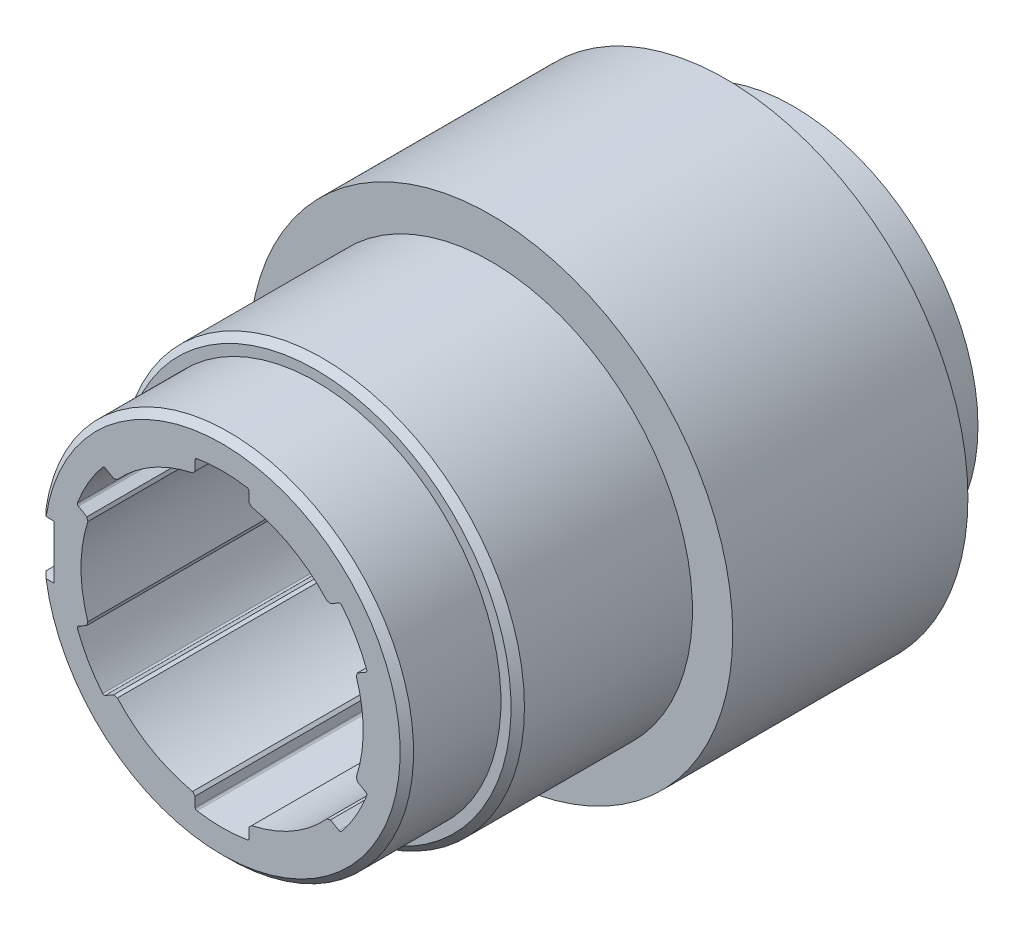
ISO-10303-21;
HEADER;
FILE_DESCRIPTION(('STEP AP214'),'2;1');
FILE_NAME('part.step','',(''),(''),'','','');
FILE_SCHEMA(('AUTOMOTIVE_DESIGN { 1 0 10303 214 1 1 1 1 }'));
ENDSEC;
DATA;
#1=APPLICATION_CONTEXT('core data for automotive mechanical design processes');
#2=APPLICATION_PROTOCOL_DEFINITION('international standard','automotive_design',2000,#1);
#3=PRODUCT_CONTEXT('',#1,'mechanical');
#4=PRODUCT('Part','Part','',(#3));
#5=PRODUCT_RELATED_PRODUCT_CATEGORY('part','',(#4));
#6=PRODUCT_DEFINITION_FORMATION('','',#4);
#7=PRODUCT_DEFINITION_CONTEXT('part definition',#1,'design');
#8=PRODUCT_DEFINITION('design','',#6,#7);
#9=PRODUCT_DEFINITION_SHAPE('','',#8);
#10=(LENGTH_UNIT() NAMED_UNIT(*) SI_UNIT(.MILLI.,.METRE.));
#11=(NAMED_UNIT(*) PLANE_ANGLE_UNIT() SI_UNIT($,.RADIAN.));
#12=(NAMED_UNIT(*) SI_UNIT($,.STERADIAN.) SOLID_ANGLE_UNIT());
#13=UNCERTAINTY_MEASURE_WITH_UNIT(LENGTH_MEASURE(1.E-05),#10,'distance_accuracy_value','');
#14=(GEOMETRIC_REPRESENTATION_CONTEXT(3) GLOBAL_UNCERTAINTY_ASSIGNED_CONTEXT((#13)) GLOBAL_UNIT_ASSIGNED_CONTEXT((#10,
#11,#12)) REPRESENTATION_CONTEXT('',''));
#15=CARTESIAN_POINT('',(0.,0.,0.));
#16=DIRECTION('',(0.,0.,1.));
#17=DIRECTION('',(1.,0.,0.));
#18=AXIS2_PLACEMENT_3D('',#15,#16,#17);
#19=CARTESIAN_POINT('',(0.,0.,85.));
#20=DIRECTION('',(0.,0.,-1.));
#21=DIRECTION('',(-1.,0.,0.));
#22=AXIS2_PLACEMENT_3D('',#19,#20,#21);
#23=CYLINDRICAL_SURFACE('',#22,27.5);
#24=DIRECTION('',(0.,0.,-1.));
#25=VECTOR('',#24,1.);
#26=CARTESIAN_POINT('',(-27.2075357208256,-4.,85.));
#27=LINE('',#26,#25);
#28=CARTESIAN_POINT('',(-27.2075357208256,-4.,71.));
#29=VERTEX_POINT('',#28);
#30=CARTESIAN_POINT('',(-27.2075357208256,-4.,84.));
#31=VERTEX_POINT('',#30);
#32=EDGE_CURVE('E696',#29,#31,#27,.F.);
#33=ORIENTED_EDGE('',*,*,#32,.F.);
#34=CARTESIAN_POINT('',(0.,0.,71.));
#35=DIRECTION('',(0.,0.,-1.));
#36=DIRECTION('',(-1.,0.,0.));
#37=AXIS2_PLACEMENT_3D('',#34,#35,#36);
#38=CIRCLE('',#37,27.5);
#39=CARTESIAN_POINT('',(-27.2075357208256,4.,71.));
#40=VERTEX_POINT('',#39);
#41=EDGE_CURVE('E1055',#40,#29,#38,.T.);
#42=ORIENTED_EDGE('',*,*,#41,.F.);
#43=DIRECTION('',(0.,0.,-1.));
#44=VECTOR('',#43,1.);
#45=CARTESIAN_POINT('',(-27.2075357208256,4.,85.));
#46=LINE('',#45,#44);
#47=CARTESIAN_POINT('',(-27.2075357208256,4.,84.));
#48=VERTEX_POINT('',#47);
#49=EDGE_CURVE('E411',#40,#48,#46,.F.);
#50=ORIENTED_EDGE('',*,*,#49,.T.);
#51=CARTESIAN_POINT('',(0.,0.,84.));
#52=DIRECTION('',(0.,0.,1.));
#53=DIRECTION('',(1.,0.,0.));
#54=AXIS2_PLACEMENT_3D('',#51,#52,#53);
#55=CIRCLE('',#54,27.5);
#56=EDGE_CURVE('E1062',#48,#31,#55,.F.);
#57=ORIENTED_EDGE('',*,*,#56,.T.);
#58=EDGE_LOOP('',(#33,#42,#50,#57));
#59=FACE_BOUND('',#58,.T.);
#60=ADVANCED_FACE('F31',(#59),#23,.T.);
#61=CARTESIAN_POINT('',(0.,0.,85.));
#62=DIRECTION('',(0.,0.,1.));
#63=DIRECTION('',(1.,0.,0.));
#64=AXIS2_PLACEMENT_3D('',#61,#62,#63);
#65=PLANE('',#64);
#66=DIRECTION('',(0.,-1.,0.));
#67=VECTOR('',#66,1.);
#68=CARTESIAN_POINT('',(-4.,22.3964282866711,85.));
#69=LINE('',#68,#67);
#70=CARTESIAN_POINT('',(-4.,22.3964282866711,85.));
#71=VERTEX_POINT('',#70);
#72=CARTESIAN_POINT('',(-4.,20.9338744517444,85.));
#73=VERTEX_POINT('',#72);
#74=EDGE_CURVE('E684',#71,#73,#69,.T.);
#75=ORIENTED_EDGE('',*,*,#74,.F.);
#76=CARTESIAN_POINT('',(-3.7,22.3964282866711,85.));
#77=DIRECTION('',(0.,0.,1.));
#78=DIRECTION('',(-1.,0.,0.));
#79=AXIS2_PLACEMENT_3D('',#76,#77,#78);
#80=CIRCLE('',#79,0.299999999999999);
#81=CARTESIAN_POINT('',(-3.7488986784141,22.692416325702,85.));
#82=VERTEX_POINT('',#81);
#83=EDGE_CURVE('E860',#82,#71,#80,.T.);
#84=ORIENTED_EDGE('',*,*,#83,.F.);
#85=CARTESIAN_POINT('',(0.,0.,85.));
#86=DIRECTION('',(0.,0.,1.));
#87=DIRECTION('',(1.,0.,0.));
#88=AXIS2_PLACEMENT_3D('',#85,#86,#87);
#89=CIRCLE('',#88,23.);
#90=CARTESIAN_POINT('',(3.74889867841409,22.692416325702,85.));
#91=VERTEX_POINT('',#90);
#92=EDGE_CURVE('E953',#91,#82,#89,.T.);
#93=ORIENTED_EDGE('',*,*,#92,.F.);
#94=CARTESIAN_POINT('',(3.7,22.3964282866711,85.));
#95=DIRECTION('',(0.,0.,1.));
#96=DIRECTION('',(1.,0.,0.));
#97=AXIS2_PLACEMENT_3D('',#94,#95,#96);
#98=CIRCLE('',#97,0.300000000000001);
#99=CARTESIAN_POINT('',(4.,22.3964282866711,85.));
#100=VERTEX_POINT('',#99);
#101=EDGE_CURVE('E951',#100,#91,#98,.T.);
#102=ORIENTED_EDGE('',*,*,#101,.F.);
#103=DIRECTION('',(2.08159154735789E-13,1.,0.));
#104=VECTOR('',#103,1.);
#105=CARTESIAN_POINT('',(4.,22.3964282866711,85.));
#106=LINE('',#105,#104);
#107=CARTESIAN_POINT('',(3.99999999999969,20.9338744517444,85.));
#108=VERTEX_POINT('',#107);
#109=EDGE_CURVE('E949',#108,#100,#106,.T.);
#110=ORIENTED_EDGE('',*,*,#109,.F.);
#111=DIRECTION('',(-0.707106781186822,0.707106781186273,0.));
#112=VECTOR('',#111,1.);
#113=CARTESIAN_POINT('',(3.99999999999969,20.9338744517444,85.));
#114=LINE('',#113,#112);
#115=CARTESIAN_POINT('',(4.4,20.5338744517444,85.));
#116=VERTEX_POINT('',#115);
#117=EDGE_CURVE('E947',#116,#108,#114,.T.);
#118=ORIENTED_EDGE('',*,*,#117,.F.);
#119=CARTESIAN_POINT('',(0.,0.,85.));
#120=DIRECTION('',(0.,0.,1.));
#121=DIRECTION('',(1.,0.,0.));
#122=AXIS2_PLACEMENT_3D('',#119,#120,#121);
#123=CIRCLE('',#122,21.);
#124=CARTESIAN_POINT('',(15.5828569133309,14.0774490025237,85.));
#125=VERTEX_POINT('',#124);
#126=EDGE_CURVE('E945',#125,#116,#123,.T.);
#127=ORIENTED_EDGE('',*,*,#126,.F.);
#128=DIRECTION('',(-0.965925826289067,0.258819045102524,0.));
#129=VECTOR('',#128,1.);
#130=CARTESIAN_POINT('',(16.1292670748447,13.9310388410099,85.));
#131=LINE('',#130,#129);
#132=CARTESIAN_POINT('',(16.1292670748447,13.9310388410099,85.));
#133=VERTEX_POINT('',#132);
#134=EDGE_CURVE('E943',#133,#125,#131,.T.);
#135=ORIENTED_EDGE('',*,*,#134,.F.);
#136=DIRECTION('',(-0.866025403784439,-0.499999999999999,0.));
#137=VECTOR('',#136,1.);
#138=CARTESIAN_POINT('',(17.3958758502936,14.6623157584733,85.));
#139=LINE('',#138,#137);
#140=CARTESIAN_POINT('',(17.3958758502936,14.6623157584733,85.));
#141=VERTEX_POINT('',#140);
#142=EDGE_CURVE('E941',#141,#133,#139,.T.);
#143=ORIENTED_EDGE('',*,*,#142,.F.);
#144=CARTESIAN_POINT('',(17.5458758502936,14.4025081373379,85.));
#145=DIRECTION('',(0.,0.,1.));
#146=DIRECTION('',(-1.,0.,0.));
#147=AXIS2_PLACEMENT_3D('',#144,#145,#146);
#148=CIRCLE('',#147,0.3);
#149=CARTESIAN_POINT('',(17.7777596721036,14.5928496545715,85.));
#150=VERTEX_POINT('',#149);
#151=EDGE_CURVE('E939',#150,#141,#148,.T.);
#152=ORIENTED_EDGE('',*,*,#151,.F.);
#153=CARTESIAN_POINT('',(0.,0.,85.));
#154=DIRECTION('',(0.,0.,1.));
#155=DIRECTION('',(1.,0.,0.));
#156=AXIS2_PLACEMENT_3D('',#153,#154,#155);
#157=CIRCLE('',#156,23.);
#158=CARTESIAN_POINT('',(21.5266583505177,8.09956667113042,85.));
#159=VERTEX_POINT('',#158);
#160=EDGE_CURVE('E937',#159,#150,#157,.T.);
#161=ORIENTED_EDGE('',*,*,#160,.F.);
#162=CARTESIAN_POINT('',(21.2458758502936,7.99392014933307,85.));
#163=DIRECTION('',(0.,0.,1.));
#164=DIRECTION('',(1.,0.,0.));
#165=AXIS2_PLACEMENT_3D('',#162,#163,#164);
#166=CIRCLE('',#165,0.300000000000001);
#167=CARTESIAN_POINT('',(21.3958758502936,7.73411252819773,85.));
#168=VERTEX_POINT('',#167);
#169=EDGE_CURVE('E935',#168,#159,#166,.T.);
#170=ORIENTED_EDGE('',*,*,#169,.F.);
#171=DIRECTION('',(0.866025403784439,0.499999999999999,0.));
#172=VECTOR('',#171,1.);
#173=CARTESIAN_POINT('',(21.3958758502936,7.73411252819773,85.));
#174=LINE('',#173,#172);
#175=CARTESIAN_POINT('',(20.1292670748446,7.00283561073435,85.));
#176=VERTEX_POINT('',#175);
#177=EDGE_CURVE('E933',#176,#168,#174,.T.);
#178=ORIENTED_EDGE('',*,*,#177,.F.);
#179=DIRECTION('',(0.258819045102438,0.96592582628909,0.));
#180=VECTOR('',#179,1.);
#181=CARTESIAN_POINT('',(20.1292670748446,7.00283561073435,85.));
#182=LINE('',#181,#180);
#183=CARTESIAN_POINT('',(19.9828569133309,6.45642544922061,85.));
#184=VERTEX_POINT('',#183);
#185=EDGE_CURVE('E931',#184,#176,#182,.T.);
#186=ORIENTED_EDGE('',*,*,#185,.F.);
#187=CARTESIAN_POINT('',(0.,0.,85.));
#188=DIRECTION('',(0.,0.,1.));
#189=DIRECTION('',(1.,0.,0.));
#190=AXIS2_PLACEMENT_3D('',#187,#188,#189);
#191=CIRCLE('',#190,21.);
#192=CARTESIAN_POINT('',(19.9828569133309,-6.45642544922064,85.));
#193=VERTEX_POINT('',#192);
#194=EDGE_CURVE('E929',#193,#184,#191,.T.);
#195=ORIENTED_EDGE('',*,*,#194,.F.);
#196=DIRECTION('',(-0.258819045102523,0.965925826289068,0.));
#197=VECTOR('',#196,1.);
#198=CARTESIAN_POINT('',(20.1292670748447,-7.00283561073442,85.));
#199=LINE('',#198,#197);
#200=CARTESIAN_POINT('',(20.1292670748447,-7.00283561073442,85.));
#201=VERTEX_POINT('',#200);
#202=EDGE_CURVE('E927',#201,#193,#199,.T.);
#203=ORIENTED_EDGE('',*,*,#202,.F.);
#204=DIRECTION('',(-0.866025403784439,0.499999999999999,0.));
#205=VECTOR('',#204,1.);
#206=CARTESIAN_POINT('',(21.3958758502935,-7.73411252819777,85.));
#207=LINE('',#206,#205);
#208=CARTESIAN_POINT('',(21.3958758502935,-7.73411252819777,85.));
#209=VERTEX_POINT('',#208);
#210=EDGE_CURVE('E925',#209,#201,#207,.T.);
#211=ORIENTED_EDGE('',*,*,#210,.F.);
#212=CARTESIAN_POINT('',(21.2458758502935,-7.9939201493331,85.));
#213=DIRECTION('',(0.,0.,1.));
#214=DIRECTION('',(-1.,0.,0.));
#215=AXIS2_PLACEMENT_3D('',#212,#213,#214);
#216=CIRCLE('',#215,0.299999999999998);
#217=CARTESIAN_POINT('',(21.5266583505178,-8.0995666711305,85.));
#218=VERTEX_POINT('',#217);
#219=EDGE_CURVE('E923',#218,#209,#216,.T.);
#220=ORIENTED_EDGE('',*,*,#219,.F.);
#221=CARTESIAN_POINT('',(0.,0.,85.));
#222=DIRECTION('',(0.,0.,1.));
#223=DIRECTION('',(1.,0.,0.));
#224=AXIS2_PLACEMENT_3D('',#221,#222,#223);
#225=CIRCLE('',#224,23.0000000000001);
#226=CARTESIAN_POINT('',(17.7777596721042,-14.5928496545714,85.));
#227=VERTEX_POINT('',#226);
#228=EDGE_CURVE('E921',#227,#218,#225,.T.);
#229=ORIENTED_EDGE('',*,*,#228,.F.);
#230=CARTESIAN_POINT('',(17.545875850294,-14.4025081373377,85.));
#231=DIRECTION('',(0.,0.,1.));
#232=DIRECTION('',(1.,0.,0.));
#233=AXIS2_PLACEMENT_3D('',#230,#231,#232);
#234=CIRCLE('',#233,0.300000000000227);
#235=CARTESIAN_POINT('',(17.3958758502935,-14.6623157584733,85.));
#236=VERTEX_POINT('',#235);
#237=EDGE_CURVE('E919',#236,#227,#234,.T.);
#238=ORIENTED_EDGE('',*,*,#237,.F.);
#239=DIRECTION('',(0.866025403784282,-0.500000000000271,0.));
#240=VECTOR('',#239,1.);
#241=CARTESIAN_POINT('',(17.3958758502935,-14.6623157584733,85.));
#242=LINE('',#241,#240);
#243=CARTESIAN_POINT('',(16.1292670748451,-13.9310388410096,85.));
#244=VERTEX_POINT('',#243);
#245=EDGE_CURVE('E917',#244,#236,#242,.T.);
#246=ORIENTED_EDGE('',*,*,#245,.F.);
#247=DIRECTION('',(0.965925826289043,0.258819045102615,0.));
#248=VECTOR('',#247,1.);
#249=CARTESIAN_POINT('',(16.1292670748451,-13.9310388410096,85.));
#250=LINE('',#249,#248);
#251=CARTESIAN_POINT('',(15.5828569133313,-14.0774490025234,85.));
#252=VERTEX_POINT('',#251);
#253=EDGE_CURVE('E915',#252,#244,#250,.T.);
#254=ORIENTED_EDGE('',*,*,#253,.F.);
#255=CARTESIAN_POINT('',(0.,0.,85.));
#256=DIRECTION('',(0.,0.,1.));
#257=DIRECTION('',(1.,0.,0.));
#258=AXIS2_PLACEMENT_3D('',#255,#256,#257);
#259=CIRCLE('',#258,21.0000000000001);
#260=CARTESIAN_POINT('',(4.40000000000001,-20.5338744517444,85.));
#261=VERTEX_POINT('',#260);
#262=EDGE_CURVE('E913',#261,#252,#259,.T.);
#263=ORIENTED_EDGE('',*,*,#262,.F.);
#264=DIRECTION('',(0.707106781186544,0.707106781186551,0.));
#265=VECTOR('',#264,1.);
#266=CARTESIAN_POINT('',(4.00000000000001,-20.9338744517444,85.));
#267=LINE('',#266,#265);
#268=CARTESIAN_POINT('',(4.00000000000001,-20.9338744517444,85.));
#269=VERTEX_POINT('',#268);
#270=EDGE_CURVE('E911',#269,#261,#267,.T.);
#271=ORIENTED_EDGE('',*,*,#270,.F.);
#272=DIRECTION('',(0.,1.,0.));
#273=VECTOR('',#272,1.);
#274=CARTESIAN_POINT('',(4.00000000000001,-22.3964282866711,85.));
#275=LINE('',#274,#273);
#276=CARTESIAN_POINT('',(4.00000000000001,-22.3964282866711,85.));
#277=VERTEX_POINT('',#276);
#278=EDGE_CURVE('E909',#277,#269,#275,.T.);
#279=ORIENTED_EDGE('',*,*,#278,.F.);
#280=CARTESIAN_POINT('',(3.70000000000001,-22.3964282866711,85.));
#281=DIRECTION('',(0.,0.,1.));
#282=DIRECTION('',(-1.,0.,0.));
#283=AXIS2_PLACEMENT_3D('',#280,#281,#282);
#284=CIRCLE('',#283,0.299999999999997);
#285=CARTESIAN_POINT('',(3.7488986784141,-22.692416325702,85.));
#286=VERTEX_POINT('',#285);
#287=EDGE_CURVE('E907',#286,#277,#284,.T.);
#288=ORIENTED_EDGE('',*,*,#287,.F.);
#289=CARTESIAN_POINT('',(0.,0.,85.));
#290=DIRECTION('',(0.,0.,1.));
#291=DIRECTION('',(1.,0.,0.));
#292=AXIS2_PLACEMENT_3D('',#289,#290,#291);
#293=CIRCLE('',#292,23.);
#294=CARTESIAN_POINT('',(-3.74889867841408,-22.692416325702,85.));
#295=VERTEX_POINT('',#294);
#296=EDGE_CURVE('E905',#295,#286,#293,.T.);
#297=ORIENTED_EDGE('',*,*,#296,.F.);
#298=CARTESIAN_POINT('',(-3.69999999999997,-22.3964282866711,85.));
#299=DIRECTION('',(0.,0.,1.));
#300=DIRECTION('',(1.,0.,0.));
#301=AXIS2_PLACEMENT_3D('',#298,#299,#300);
#302=CIRCLE('',#301,0.300000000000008);
#303=CARTESIAN_POINT('',(-4.,-22.3964282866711,85.));
#304=VERTEX_POINT('',#303);
#305=EDGE_CURVE('E903',#304,#295,#302,.T.);
#306=ORIENTED_EDGE('',*,*,#305,.F.);
#307=DIRECTION('',(0.,-1.,0.));
#308=VECTOR('',#307,1.);
#309=CARTESIAN_POINT('',(-4.,-22.3964282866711,85.));
#310=LINE('',#309,#308);
#311=CARTESIAN_POINT('',(-3.99999999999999,-20.9338744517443,85.));
#312=VERTEX_POINT('',#311);
#313=EDGE_CURVE('E901',#312,#304,#310,.T.);
#314=ORIENTED_EDGE('',*,*,#313,.F.);
#315=DIRECTION('',(0.707106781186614,-0.707106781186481,0.));
#316=VECTOR('',#315,1.);
#317=CARTESIAN_POINT('',(-3.99999999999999,-20.9338744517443,85.));
#318=LINE('',#317,#316);
#319=CARTESIAN_POINT('',(-4.4,-20.5338744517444,85.));
#320=VERTEX_POINT('',#319);
#321=EDGE_CURVE('E899',#320,#312,#318,.T.);
#322=ORIENTED_EDGE('',*,*,#321,.F.);
#323=CARTESIAN_POINT('',(0.,0.,85.));
#324=DIRECTION('',(0.,0.,1.));
#325=DIRECTION('',(1.,0.,0.));
#326=AXIS2_PLACEMENT_3D('',#323,#324,#325);
#327=CIRCLE('',#326,21.);
#328=CARTESIAN_POINT('',(-15.5828569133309,-14.0774490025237,85.));
#329=VERTEX_POINT('',#328);
#330=EDGE_CURVE('E897',#329,#320,#327,.T.);
#331=ORIENTED_EDGE('',*,*,#330,.F.);
#332=DIRECTION('',(0.965925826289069,-0.258819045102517,0.));
#333=VECTOR('',#332,1.);
#334=CARTESIAN_POINT('',(-16.1292670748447,-13.9310388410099,85.));
#335=LINE('',#334,#333);
#336=CARTESIAN_POINT('',(-16.1292670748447,-13.9310388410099,85.));
#337=VERTEX_POINT('',#336);
#338=EDGE_CURVE('E895',#337,#329,#335,.T.);
#339=ORIENTED_EDGE('',*,*,#338,.F.);
#340=DIRECTION('',(0.866025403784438,0.500000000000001,0.));
#341=VECTOR('',#340,1.);
#342=CARTESIAN_POINT('',(-17.3958758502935,-14.6623157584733,85.));
#343=LINE('',#342,#341);
#344=CARTESIAN_POINT('',(-17.3958758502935,-14.6623157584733,85.));
#345=VERTEX_POINT('',#344);
#346=EDGE_CURVE('E893',#345,#337,#343,.T.);
#347=ORIENTED_EDGE('',*,*,#346,.F.);
#348=CARTESIAN_POINT('',(-17.5458758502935,-14.402508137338,85.));
#349=DIRECTION('',(0.,0.,1.));
#350=DIRECTION('',(-1.,0.,0.));
#351=AXIS2_PLACEMENT_3D('',#348,#349,#350);
#352=CIRCLE('',#351,0.299999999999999);
#353=CARTESIAN_POINT('',(-17.7777596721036,-14.5928496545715,85.));
#354=VERTEX_POINT('',#353);
#355=EDGE_CURVE('E891',#354,#345,#352,.T.);
#356=ORIENTED_EDGE('',*,*,#355,.F.);
#357=CARTESIAN_POINT('',(0.,0.,85.));
#358=DIRECTION('',(0.,0.,1.));
#359=DIRECTION('',(1.,0.,0.));
#360=AXIS2_PLACEMENT_3D('',#357,#358,#359);
#361=CIRCLE('',#360,23.);
#362=CARTESIAN_POINT('',(-21.5266583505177,-8.09956667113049,85.));
#363=VERTEX_POINT('',#362);
#364=EDGE_CURVE('E889',#363,#354,#361,.T.);
#365=ORIENTED_EDGE('',*,*,#364,.F.);
#366=CARTESIAN_POINT('',(-21.2458758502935,-7.99392014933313,85.));
#367=DIRECTION('',(0.,0.,1.));
#368=DIRECTION('',(1.,0.,0.));
#369=AXIS2_PLACEMENT_3D('',#366,#367,#368);
#370=CIRCLE('',#369,0.300000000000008);
#371=CARTESIAN_POINT('',(-21.3958758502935,-7.73411252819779,85.));
#372=VERTEX_POINT('',#371);
#373=EDGE_CURVE('E887',#372,#363,#370,.T.);
#374=ORIENTED_EDGE('',*,*,#373,.F.);
#375=DIRECTION('',(-0.866025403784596,-0.499999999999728,0.));
#376=VECTOR('',#375,1.);
#377=CARTESIAN_POINT('',(-21.3958758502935,-7.73411252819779,85.));
#378=LINE('',#377,#376);
#379=CARTESIAN_POINT('',(-20.1292670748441,-7.00283561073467,85.));
#380=VERTEX_POINT('',#379);
#381=EDGE_CURVE('E885',#380,#372,#378,.T.);
#382=ORIENTED_EDGE('',*,*,#381,.F.);
#383=DIRECTION('',(-0.258819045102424,-0.965925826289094,0.));
#384=VECTOR('',#383,1.);
#385=CARTESIAN_POINT('',(-20.1292670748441,-7.00283561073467,85.));
#386=LINE('',#385,#384);
#387=CARTESIAN_POINT('',(-19.9828569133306,-6.45642544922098,85.));
#388=VERTEX_POINT('',#387);
#389=EDGE_CURVE('E883',#388,#380,#386,.T.);
#390=ORIENTED_EDGE('',*,*,#389,.F.);
#391=CARTESIAN_POINT('',(0.,0.,85.));
#392=DIRECTION('',(0.,0.,1.));
#393=DIRECTION('',(1.,0.,0.));
#394=AXIS2_PLACEMENT_3D('',#391,#392,#393);
#395=CIRCLE('',#394,20.9999999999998);
#396=CARTESIAN_POINT('',(-19.9828569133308,6.45642544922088,85.));
#397=VERTEX_POINT('',#396);
#398=EDGE_CURVE('E881',#397,#388,#395,.T.);
#399=ORIENTED_EDGE('',*,*,#398,.F.);
#400=DIRECTION('',(0.258819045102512,-0.965925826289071,0.));
#401=VECTOR('',#400,1.);
#402=CARTESIAN_POINT('',(-20.1292670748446,7.00283561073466,85.));
#403=LINE('',#402,#401);
#404=CARTESIAN_POINT('',(-20.1292670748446,7.00283561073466,85.));
#405=VERTEX_POINT('',#404);
#406=EDGE_CURVE('E879',#405,#397,#403,.T.);
#407=ORIENTED_EDGE('',*,*,#406,.F.);
#408=DIRECTION('',(0.866025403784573,-0.499999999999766,0.));
#409=VECTOR('',#408,1.);
#410=CARTESIAN_POINT('',(-21.3958758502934,7.73411252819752,85.));
#411=LINE('',#410,#409);
#412=CARTESIAN_POINT('',(-21.3958758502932,7.7341125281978,85.));
#413=VERTEX_POINT('',#412);
#414=EDGE_CURVE('E877',#413,#405,#411,.T.);
#415=ORIENTED_EDGE('',*,*,#414,.F.);
#416=CARTESIAN_POINT('',(-21.2458758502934,7.99392014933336,85.));
#417=DIRECTION('',(0.,0.,1.));
#418=DIRECTION('',(-1.,0.,0.));
#419=AXIS2_PLACEMENT_3D('',#416,#417,#418);
#420=CIRCLE('',#419,0.300000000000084);
#421=CARTESIAN_POINT('',(-21.5266583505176,8.09956667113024,85.));
#422=VERTEX_POINT('',#421);
#423=EDGE_CURVE('E875',#422,#413,#420,.T.);
#424=ORIENTED_EDGE('',*,*,#423,.F.);
#425=CARTESIAN_POINT('',(0.,0.,85.));
#426=DIRECTION('',(0.,0.,1.));
#427=DIRECTION('',(1.,0.,0.));
#428=AXIS2_PLACEMENT_3D('',#425,#426,#427);
#429=CIRCLE('',#428,22.9999999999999);
#430=CARTESIAN_POINT('',(-17.7777596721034,14.5928496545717,85.));
#431=VERTEX_POINT('',#430);
#432=EDGE_CURVE('E873',#431,#422,#429,.T.);
#433=ORIENTED_EDGE('',*,*,#432,.F.);
#434=CARTESIAN_POINT('',(-17.5458758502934,14.4025081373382,85.));
#435=DIRECTION('',(0.,0.,1.));
#436=DIRECTION('',(1.,0.,0.));
#437=AXIS2_PLACEMENT_3D('',#434,#435,#436);
#438=CIRCLE('',#437,0.300000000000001);
#439=CARTESIAN_POINT('',(-17.3958758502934,14.6623157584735,85.));
#440=VERTEX_POINT('',#439);
#441=EDGE_CURVE('E871',#440,#431,#438,.T.);
#442=ORIENTED_EDGE('',*,*,#441,.F.);
#443=DIRECTION('',(-0.866025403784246,0.500000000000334,0.));
#444=VECTOR('',#443,1.);
#445=CARTESIAN_POINT('',(-17.3958758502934,14.6623157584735,85.));
#446=LINE('',#445,#444);
#447=CARTESIAN_POINT('',(-16.1292670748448,13.9310388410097,85.));
#448=VERTEX_POINT('',#447);
#449=EDGE_CURVE('E869',#448,#440,#446,.T.);
#450=ORIENTED_EDGE('',*,*,#449,.F.);
#451=DIRECTION('',(-0.965925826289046,-0.258819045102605,0.));
#452=VECTOR('',#451,1.);
#453=CARTESIAN_POINT('',(-16.1292670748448,13.9310388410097,85.));
#454=LINE('',#453,#452);
#455=CARTESIAN_POINT('',(-15.5828569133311,14.0774490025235,85.));
#456=VERTEX_POINT('',#455);
#457=EDGE_CURVE('E867',#456,#448,#454,.T.);
#458=ORIENTED_EDGE('',*,*,#457,.F.);
#459=CARTESIAN_POINT('',(0.,0.,85.));
#460=DIRECTION('',(0.,0.,1.));
#461=DIRECTION('',(1.,0.,0.));
#462=AXIS2_PLACEMENT_3D('',#459,#460,#461);
#463=CIRCLE('',#462,21.);
#464=CARTESIAN_POINT('',(-4.4,20.5338744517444,85.));
#465=VERTEX_POINT('',#464);
#466=EDGE_CURVE('E865',#465,#456,#463,.T.);
#467=ORIENTED_EDGE('',*,*,#466,.F.);
#468=DIRECTION('',(-0.707106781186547,-0.707106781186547,0.));
#469=VECTOR('',#468,1.);
#470=CARTESIAN_POINT('',(-4.,20.9338744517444,85.));
#471=LINE('',#470,#469);
#472=EDGE_CURVE('E863',#73,#465,#471,.T.);
#473=ORIENTED_EDGE('',*,*,#472,.F.);
#474=EDGE_LOOP('',(#75,#84,#93,#102,#110,#118,#127,#135,#143,#152,#161,#170,#178,#186,#195,#203,
#211,#220,#229,#238,#246,#254,#263,#271,#279,#288,#297,#306,#314,#322,#331,#339,#347,#356,#365,
#374,#382,#390,#399,#407,#415,#424,#433,#442,#450,#458,#467,#473));
#475=FACE_BOUND('',#474,.T.);
#476=DIRECTION('',(0.,1.,0.));
#477=VECTOR('',#476,1.);
#478=CARTESIAN_POINT('',(-25.,0.,85.));
#479=LINE('',#478,#477);
#480=CARTESIAN_POINT('',(-25.,-4.,85.));
#481=VERTEX_POINT('',#480);
#482=CARTESIAN_POINT('',(-25.,4.,85.));
#483=VERTEX_POINT('',#482);
#484=EDGE_CURVE('E11',#481,#483,#479,.T.);
#485=ORIENTED_EDGE('',*,*,#484,.F.);
#486=DIRECTION('',(-1.,0.,0.));
#487=VECTOR('',#486,1.);
#488=CARTESIAN_POINT('',(0.,-4.,85.));
#489=LINE('',#488,#487);
#490=CARTESIAN_POINT('',(-26.1963737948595,-4.,85.));
#491=VERTEX_POINT('',#490);
#492=EDGE_CURVE('E687',#481,#491,#489,.T.);
#493=ORIENTED_EDGE('',*,*,#492,.T.);
#494=CARTESIAN_POINT('',(0.,0.,85.));
#495=DIRECTION('',(0.,0.,1.));
#496=DIRECTION('',(1.,0.,0.));
#497=AXIS2_PLACEMENT_3D('',#494,#495,#496);
#498=CIRCLE('',#497,26.5);
#499=CARTESIAN_POINT('',(-26.1963737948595,4.,85.));
#500=VERTEX_POINT('',#499);
#501=EDGE_CURVE('E689',#491,#500,#498,.T.);
#502=ORIENTED_EDGE('',*,*,#501,.T.);
#503=DIRECTION('',(-1.,0.,0.));
#504=VECTOR('',#503,1.);
#505=CARTESIAN_POINT('',(0.,4.,85.));
#506=LINE('',#505,#504);
#507=EDGE_CURVE('E421',#483,#500,#506,.T.);
#508=ORIENTED_EDGE('',*,*,#507,.F.);
#509=EDGE_LOOP('',(#485,#493,#502,#508));
#510=FACE_BOUND('',#509,.T.);
#511=ADVANCED_FACE('F671',(#475,#510),#65,.T.);
#512=CARTESIAN_POINT('',(30.,0.,71.));
#513=DIRECTION('',(0.,0.,-1.));
#514=DIRECTION('',(-1.,0.,0.));
#515=AXIS2_PLACEMENT_3D('',#512,#513,#514);
#516=PLANE('',#515);
#517=DIRECTION('',(1.,0.,0.));
#518=VECTOR('',#517,1.);
#519=CARTESIAN_POINT('',(30.,-4.,71.));
#520=LINE('',#519,#518);
#521=CARTESIAN_POINT('',(-28.7228132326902,-4.,71.));
#522=VERTEX_POINT('',#521);
#523=EDGE_CURVE('E692',#522,#29,#520,.T.);
#524=ORIENTED_EDGE('',*,*,#523,.F.);
#525=CARTESIAN_POINT('',(0.,0.,71.));
#526=DIRECTION('',(0.,0.,-1.));
#527=DIRECTION('',(-1.,0.,0.));
#528=AXIS2_PLACEMENT_3D('',#525,#526,#527);
#529=CIRCLE('',#528,29.);
#530=CARTESIAN_POINT('',(-28.7228132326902,4.,71.));
#531=VERTEX_POINT('',#530);
#532=EDGE_CURVE('E442',#522,#531,#529,.F.);
#533=ORIENTED_EDGE('',*,*,#532,.T.);
#534=DIRECTION('',(1.,0.,0.));
#535=VECTOR('',#534,1.);
#536=CARTESIAN_POINT('',(30.,4.,71.));
#537=LINE('',#536,#535);
#538=EDGE_CURVE('E46',#531,#40,#537,.T.);
#539=ORIENTED_EDGE('',*,*,#538,.T.);
#540=ORIENTED_EDGE('',*,*,#41,.T.);
#541=EDGE_LOOP('',(#524,#533,#539,#540));
#542=FACE_BOUND('',#541,.T.);
#543=ADVANCED_FACE('F464',(#542),#516,.F.);
#544=CARTESIAN_POINT('',(0.,0.,0.));
#545=DIRECTION('',(0.,0.,-1.));
#546=DIRECTION('',(-1.,0.,0.));
#547=AXIS2_PLACEMENT_3D('',#544,#545,#546);
#548=CYLINDRICAL_SURFACE('',#547,30.);
#549=CARTESIAN_POINT('',(0.,0.,45.));
#550=DIRECTION('',(0.,0.,-1.));
#551=DIRECTION('',(-1.,0.,0.));
#552=AXIS2_PLACEMENT_3D('',#549,#550,#551);
#553=CIRCLE('',#552,30.);
#554=CARTESIAN_POINT('',(-30.,0.,45.));
#555=VERTEX_POINT('',#554);
#556=EDGE_CURVE('E707',#555,#555,#553,.T.);
#557=ORIENTED_EDGE('',*,*,#556,.F.);
#558=EDGE_LOOP('',(#557));
#559=FACE_BOUND('',#558,.T.);
#560=DIRECTION('',(0.,0.,-1.));
#561=VECTOR('',#560,1.);
#562=CARTESIAN_POINT('',(-29.732137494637,-4.,0.));
#563=LINE('',#562,#561);
#564=CARTESIAN_POINT('',(-29.732137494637,-4.,58.0813168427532));
#565=VERTEX_POINT('',#564);
#566=CARTESIAN_POINT('',(-29.732137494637,-4.,70.));
#567=VERTEX_POINT('',#566);
#568=EDGE_CURVE('E691',#565,#567,#563,.F.);
#569=ORIENTED_EDGE('',*,*,#568,.F.);
#570=CARTESIAN_POINT('',(-30.,0.,84.228756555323));
#571=CARTESIAN_POINT('',(-30.0000021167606,-0.516636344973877,84.2287540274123));
#572=CARTESIAN_POINT('',(-29.9866377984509,-1.03323863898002,84.2136500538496));
#573=CARTESIAN_POINT('',(-29.9333970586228,-2.06344066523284,84.1529139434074));
#574=CARTESIAN_POINT('',(-29.8935135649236,-2.57703955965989,84.1072736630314));
#575=CARTESIAN_POINT('',(-29.7878095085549,-3.59869335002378,83.9844458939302));
#576=CARTESIAN_POINT('',(-29.7219437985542,-4.10673700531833,83.9072034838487));
#577=CARTESIAN_POINT('',(-29.5654897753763,-5.1128193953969,83.719701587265));
#578=CARTESIAN_POINT('',(-29.4749035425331,-5.61085896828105,83.6094448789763));
#579=CARTESIAN_POINT('',(-29.2702338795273,-6.59605864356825,83.353198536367));
#580=CARTESIAN_POINT('',(-29.1560141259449,-7.08313658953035,83.2070006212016));
#581=CARTESIAN_POINT('',(-28.9070483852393,-8.03905808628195,82.8768533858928));
#582=CARTESIAN_POINT('',(-28.7722999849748,-8.50789948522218,82.6928996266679));
#583=CARTESIAN_POINT('',(-28.4862109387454,-9.42148778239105,82.2852398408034));
#584=CARTESIAN_POINT('',(-28.3349056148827,-9.86628306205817,82.0616178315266));
#585=CARTESIAN_POINT('',(-28.0202099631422,-10.7274283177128,81.5721925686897));
#586=CARTESIAN_POINT('',(-27.8568250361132,-11.1437908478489,81.3064081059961));
#587=CARTESIAN_POINT('',(-27.5723709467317,-11.8261866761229,80.814946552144));
#588=CARTESIAN_POINT('',(-27.4528238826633,-12.1007071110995,80.6001059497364));
#589=CARTESIAN_POINT('',(-27.2131034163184,-12.630576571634,80.1483154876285));
#590=CARTESIAN_POINT('',(-27.092930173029,-12.8859302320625,79.911371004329));
#591=CARTESIAN_POINT('',(-26.8546689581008,-13.3753825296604,79.4156134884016));
#592=CARTESIAN_POINT('',(-26.7365803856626,-13.6094873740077,79.156806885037));
#593=CARTESIAN_POINT('',(-26.505318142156,-14.054573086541,78.617918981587));
#594=CARTESIAN_POINT('',(-26.3921446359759,-14.2655531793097,78.3378369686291));
#595=CARTESIAN_POINT('',(-26.1729773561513,-14.6638082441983,77.7557754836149));
#596=CARTESIAN_POINT('',(-26.067033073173,-14.8509262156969,77.4536696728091));
#597=CARTESIAN_POINT('',(-25.8660580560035,-15.1982675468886,76.8308917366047));
#598=CARTESIAN_POINT('',(-25.7710275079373,-15.3584904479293,76.5102192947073));
#599=CARTESIAN_POINT('',(-25.5946609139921,-15.6506380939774,75.8526938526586));
#600=CARTESIAN_POINT('',(-25.5133218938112,-15.782568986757,75.5158443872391));
#601=CARTESIAN_POINT('',(-25.3667526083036,-16.0170853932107,74.828700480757));
#602=CARTESIAN_POINT('',(-25.3015205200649,-16.1196742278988,74.4784075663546));
#603=CARTESIAN_POINT('',(-25.1952394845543,-16.2852229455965,73.8061401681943));
#604=CARTESIAN_POINT('',(-25.1523348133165,-16.3512744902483,73.4852158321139));
#605=CARTESIAN_POINT('',(-25.0819408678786,-16.4590523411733,72.8376500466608));
#606=CARTESIAN_POINT('',(-25.0544504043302,-16.5007805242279,72.5110090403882));
#607=CARTESIAN_POINT('',(-25.0155664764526,-16.5596703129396,71.8546722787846));
#608=CARTESIAN_POINT('',(-25.004168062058,-16.5768394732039,71.5249774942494));
#609=CARTESIAN_POINT('',(-24.997733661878,-16.5865412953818,70.8650664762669));
#610=CARTESIAN_POINT('',(-25.0026973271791,-16.5790744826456,70.5348502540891));
#611=CARTESIAN_POINT('',(-25.0281585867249,-16.5406094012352,69.8942168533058));
#612=CARTESIAN_POINT('',(-25.0478087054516,-16.5108947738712,69.5836877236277));
#613=CARTESIAN_POINT('',(-25.101212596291,-16.4295919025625,68.9667475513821));
#614=CARTESIAN_POINT('',(-25.1349656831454,-16.3780047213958,68.6603363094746));
#615=CARTESIAN_POINT('',(-25.2158277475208,-16.2532318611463,68.053793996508));
#616=CARTESIAN_POINT('',(-25.2629347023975,-16.1800494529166,67.7536619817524));
#617=CARTESIAN_POINT('',(-25.3694793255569,-16.0124752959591,67.1616238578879));
#618=CARTESIAN_POINT('',(-25.4289172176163,-15.9180831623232,66.8697178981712));
#619=CARTESIAN_POINT('',(-25.5593672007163,-15.7077741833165,66.2936507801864));
#620=CARTESIAN_POINT('',(-25.6304688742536,-15.5916896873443,66.0095711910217));
#621=CARTESIAN_POINT('',(-25.7823705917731,-15.3392000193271,65.4533019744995));
#622=CARTESIAN_POINT('',(-25.8631705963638,-15.202794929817,65.1811122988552));
#623=CARTESIAN_POINT('',(-26.03278075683,-14.9104950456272,64.6500144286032));
#624=CARTESIAN_POINT('',(-26.1215913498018,-14.7545991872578,64.3911069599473));
#625=CARTESIAN_POINT('',(-26.3054285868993,-14.4242901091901,63.8876988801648));
#626=CARTESIAN_POINT('',(-26.4004558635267,-14.2498750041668,63.6431997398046));
#627=CARTESIAN_POINT('',(-26.6012285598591,-13.871675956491,63.1540069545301));
#628=CARTESIAN_POINT('',(-26.7072687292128,-13.6667181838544,62.9103420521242));
#629=CARTESIAN_POINT('',(-26.9221051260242,-13.2384906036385,62.4410077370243));
#630=CARTESIAN_POINT('',(-27.0309014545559,-13.0152201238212,62.2153389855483));
#631=CARTESIAN_POINT('',(-27.2491669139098,-12.5518324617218,61.7822588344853));
#632=CARTESIAN_POINT('',(-27.3586362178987,-12.3117107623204,61.5748523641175));
#633=CARTESIAN_POINT('',(-27.5762610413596,-11.8162204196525,61.1783668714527));
#634=CARTESIAN_POINT('',(-27.6844164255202,-11.5608502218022,60.9892897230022));
#635=CARTESIAN_POINT('',(-27.9119257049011,-11.0012456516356,60.6050954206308));
#636=CARTESIAN_POINT('',(-28.0308360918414,-10.6950511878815,60.4125691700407));
#637=CARTESIAN_POINT('',(-28.2623771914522,-10.0672737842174,60.0501949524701));
#638=CARTESIAN_POINT('',(-28.3750074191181,-9.74568965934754,59.8803487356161));
#639=CARTESIAN_POINT('',(-28.5920954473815,-9.08909706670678,59.5624416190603));
#640=CARTESIAN_POINT('',(-28.696549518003,-8.75408257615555,59.4143906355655));
#641=CARTESIAN_POINT('',(-28.8956207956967,-8.07273882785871,59.139232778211));
#642=CARTESIAN_POINT('',(-28.9902374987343,-7.72640899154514,59.0121269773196));
#643=CARTESIAN_POINT('',(-29.1849068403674,-6.95885920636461,58.7560895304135));
#644=CARTESIAN_POINT('',(-29.2826909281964,-6.53570270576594,58.6312252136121));
#645=CARTESIAN_POINT('',(-29.460860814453,-5.67884307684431,58.4081168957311));
#646=CARTESIAN_POINT('',(-29.5412448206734,-5.24513886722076,58.3098756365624));
#647=CARTESIAN_POINT('',(-29.6833946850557,-4.36954134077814,58.1386628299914));
#648=CARTESIAN_POINT('',(-29.7451509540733,-3.92764393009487,58.0657042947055));
#649=CARTESIAN_POINT('',(-29.849113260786,-3.03824960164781,57.9440815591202));
#650=CARTESIAN_POINT('',(-29.8913183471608,-2.59075241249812,57.8954185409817));
#651=CARTESIAN_POINT('',(-29.96089714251,-1.6184936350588,57.8155879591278));
#652=CARTESIAN_POINT('',(-29.9846919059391,-1.09312438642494,57.788611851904));
#653=CARTESIAN_POINT('',(-30.0045855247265,-0.0411566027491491,57.7660382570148));
#654=CARTESIAN_POINT('',(-30.0006814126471,0.485442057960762,57.7704441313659));
#655=CARTESIAN_POINT('',(-29.965222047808,1.53703720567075,57.8107548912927));
#656=CARTESIAN_POINT('',(-29.9336393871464,2.06203158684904,57.8466909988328));
#657=CARTESIAN_POINT('',(-29.8433351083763,3.10646143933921,57.9508524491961));
#658=CARTESIAN_POINT('',(-29.7846136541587,3.6258969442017,58.0190775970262));
#659=CARTESIAN_POINT('',(-29.6371991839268,4.6836728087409,58.19382267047));
#660=CARTESIAN_POINT('',(-29.5470483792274,5.22150261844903,58.3022253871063));
#661=CARTESIAN_POINT('',(-29.339785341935,6.28244515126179,58.5587435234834));
#662=CARTESIAN_POINT('',(-29.222669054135,6.80555564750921,58.7068649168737));
#663=CARTESIAN_POINT('',(-28.9647298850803,7.83092636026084,59.0452812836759));
#664=CARTESIAN_POINT('',(-28.8239483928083,8.33322110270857,59.2355028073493));
#665=CARTESIAN_POINT('',(-28.5227625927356,9.31202583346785,59.6611918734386));
#666=CARTESIAN_POINT('',(-28.3623673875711,9.78854763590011,59.8966384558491));
#667=CARTESIAN_POINT('',(-28.0776715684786,10.5717856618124,60.3378467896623));
#668=CARTESIAN_POINT('',(-27.95691035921,10.8866872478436,60.5314496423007));
#669=CARTESIAN_POINT('',(-27.7109363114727,11.4983713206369,60.9428774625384));
#670=CARTESIAN_POINT('',(-27.5857246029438,11.7951583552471,61.1606963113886));
#671=CARTESIAN_POINT('',(-27.3336327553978,12.3681234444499,61.6208617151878));
#672=CARTESIAN_POINT('',(-27.2067533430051,12.6443101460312,61.8631978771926));
#673=CARTESIAN_POINT('',(-26.9543479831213,13.1738056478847,62.3724180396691));
#674=CARTESIAN_POINT('',(-26.8288220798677,13.4271137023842,62.6393028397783));
#675=CARTESIAN_POINT('',(-26.5815072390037,13.9103464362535,63.1991376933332));
#676=CARTESIAN_POINT('',(-26.459754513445,14.1400760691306,63.4922726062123));
#677=CARTESIAN_POINT('',(-26.2245407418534,14.5716816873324,64.1015419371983));
#678=CARTESIAN_POINT('',(-26.1110798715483,14.7735570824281,64.4176768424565));
#679=CARTESIAN_POINT('',(-25.895995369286,15.1474075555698,65.0708217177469));
#680=CARTESIAN_POINT('',(-25.7943672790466,15.319393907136,65.4078237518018));
#681=CARTESIAN_POINT('',(-25.6061916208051,15.6318991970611,66.1001246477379));
#682=CARTESIAN_POINT('',(-25.5196417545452,15.7724229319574,66.4554207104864));
#683=CARTESIAN_POINT('',(-25.3745361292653,16.0046603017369,67.134052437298));
#684=CARTESIAN_POINT('',(-25.3138071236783,16.1003370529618,67.4555742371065));
#685=CARTESIAN_POINT('',(-25.2075061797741,16.2662645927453,68.1075556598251));
#686=CARTESIAN_POINT('',(-25.1619328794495,16.3365176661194,68.438014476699));
#687=CARTESIAN_POINT('',(-25.0871415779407,16.4511403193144,69.1050899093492));
#688=CARTESIAN_POINT('',(-25.0579177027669,16.495519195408,69.4417042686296));
#689=CARTESIAN_POINT('',(-25.0165655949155,16.5581662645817,70.1183949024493));
#690=CARTESIAN_POINT('',(-25.0044366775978,16.5764355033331,70.4584710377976));
#691=CARTESIAN_POINT('',(-24.9978466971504,16.5863698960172,71.1133652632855));
#692=CARTESIAN_POINT('',(-25.0021160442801,16.5799467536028,71.4281438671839));
#693=CARTESIAN_POINT('',(-25.0254226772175,16.5447475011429,72.0558842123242));
#694=CARTESIAN_POINT('',(-25.0444589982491,16.5159728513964,72.3688460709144));
#695=CARTESIAN_POINT('',(-25.0968674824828,16.4362255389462,72.9906397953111));
#696=CARTESIAN_POINT('',(-25.1302365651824,16.3852576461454,73.2994725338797));
#697=CARTESIAN_POINT('',(-25.2105660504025,16.2613898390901,73.9109077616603));
#698=CARTESIAN_POINT('',(-25.2575266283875,16.1884896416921,74.2135101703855));
#699=CARTESIAN_POINT('',(-25.363661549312,16.0216843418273,74.8085396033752));
#700=CARTESIAN_POINT('',(-25.4227567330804,15.9279150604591,75.1010188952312));
#701=CARTESIAN_POINT('',(-25.5520614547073,15.7196426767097,75.6759500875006));
#702=CARTESIAN_POINT('',(-25.6222708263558,15.6051398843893,75.9584021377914));
#703=CARTESIAN_POINT('',(-25.7723180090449,15.3560654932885,76.5116613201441));
#704=CARTESIAN_POINT('',(-25.8521562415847,15.2214930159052,76.7824679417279));
#705=CARTESIAN_POINT('',(-26.0198080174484,14.9330974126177,77.3110381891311));
#706=CARTESIAN_POINT('',(-26.1076218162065,14.7792736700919,77.568801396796));
#707=CARTESIAN_POINT('',(-26.2939357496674,14.4453195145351,78.082473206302));
#708=CARTESIAN_POINT('',(-26.3927488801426,14.264268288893,78.3376693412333));
#709=CARTESIAN_POINT('',(-26.5951807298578,13.8831883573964,78.8315971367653));
#710=CARTESIAN_POINT('',(-26.6988014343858,13.6831517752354,79.0703218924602));
#711=CARTESIAN_POINT('',(-26.9087648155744,13.2654815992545,79.5306047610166));
#712=CARTESIAN_POINT('',(-27.0151079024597,13.0478453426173,79.752160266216));
#713=CARTESIAN_POINT('',(-27.2284879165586,12.5964973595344,80.1776908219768));
#714=CARTESIAN_POINT('',(-27.3355246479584,12.3627900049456,80.3816706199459));
#715=CARTESIAN_POINT('',(-27.5608291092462,11.8527271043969,80.7947390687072));
#716=CARTESIAN_POINT('',(-27.6789597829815,11.5745687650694,81.0016769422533));
#717=CARTESIAN_POINT('',(-27.9114983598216,11.0019890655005,81.3939948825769));
#718=CARTESIAN_POINT('',(-28.0259060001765,10.7075665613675,81.5793734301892));
#719=CARTESIAN_POINT('',(-28.2490289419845,10.1042497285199,81.9292291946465));
#720=CARTESIAN_POINT('',(-28.3577406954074,9.79534660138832,82.093693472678));
#721=CARTESIAN_POINT('',(-28.5676630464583,9.16509666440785,82.4023302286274));
#722=CARTESIAN_POINT('',(-28.6688727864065,8.84374843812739,82.5465003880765));
#723=CARTESIAN_POINT('',(-28.8795280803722,8.13227005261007,82.839277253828));
#724=CARTESIAN_POINT('',(-28.9872374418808,7.74007082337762,82.9841134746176));
#725=CARTESIAN_POINT('',(-29.188287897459,6.94353403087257,83.2481545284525));
#726=CARTESIAN_POINT('',(-29.2816268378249,6.53919465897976,83.3673555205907));
#727=CARTESIAN_POINT('',(-29.4524144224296,5.72100099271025,83.5813884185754));
#728=CARTESIAN_POINT('',(-29.5298687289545,5.30715014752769,83.6762290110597));
#729=CARTESIAN_POINT('',(-29.6678127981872,4.4721392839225,83.8427281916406));
#730=CARTESIAN_POINT('',(-29.728305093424,4.05098036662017,83.9143902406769));
#731=CARTESIAN_POINT('',(-29.852691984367,3.02963958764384,84.0603182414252));
#732=CARTESIAN_POINT('',(-29.907833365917,2.42678102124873,84.1236304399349));
#733=CARTESIAN_POINT('',(-29.9814865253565,1.21593266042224,84.2078515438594));
#734=CARTESIAN_POINT('',(-29.9999975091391,0.607942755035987,84.2287595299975));
#735=CARTESIAN_POINT('',(-30.,0.,84.228756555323));
#736=B_SPLINE_CURVE_WITH_KNOTS('',3,(#570,#571,#572,#573,#574,#575,#576,#577,#578,#579,#580,
#581,#582,#583,#584,#585,#586,#587,#588,#589,#590,#591,#592,#593,#594,#595,#596,#597,#598,#599,
#600,#601,#602,#603,#604,#605,#606,#607,#608,#609,#610,#611,#612,#613,#614,#615,#616,#617,#618,
#619,#620,#621,#622,#623,#624,#625,#626,#627,#628,#629,#630,#631,#632,#633,#634,#635,#636,#637,
#638,#639,#640,#641,#642,#643,#644,#645,#646,#647,#648,#649,#650,#651,#652,#653,#654,#655,#656,
#657,#658,#659,#660,#661,#662,#663,#664,#665,#666,#667,#668,#669,#670,#671,#672,#673,#674,#675,
#676,#677,#678,#679,#680,#681,#682,#683,#684,#685,#686,#687,#688,#689,#690,#691,#692,#693,#694,
#695,#696,#697,#698,#699,#700,#701,#702,#703,#704,#705,#706,#707,#708,#709,#710,#711,#712,#713,
#714,#715,#716,#717,#718,#719,#720,#721,#722,#723,#724,#725,#726,#727,#728,#729,#730,#731,#732,
#733,#734,#735),.UNSPECIFIED.,.T.,.F.,(4,2,2,2,2,2,2,2,2,2,2,2,2,2,2,2,2,2,2,2,2,2,2,2,2,2,2,2,
2,2,2,2,2,2,2,2,2,2,2,2,2,2,2,2,2,2,2,2,2,2,2,2,2,2,2,2,2,2,2,2,2,2,2,2,2,2,2,2,2,2,2,2,2,2,2,2,
2,2,2,2,2,2,4),(0.,1.54945436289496,3.09932210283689,4.65189487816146,6.20433703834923,
7.76599698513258,9.3278406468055,10.8864149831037,12.4442966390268,13.5488233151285,
14.6530820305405,15.7570171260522,16.8609892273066,17.9718863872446,19.0828024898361,
20.1934769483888,21.3040256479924,22.2941039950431,23.284105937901,24.2738032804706,
25.2634795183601,26.2000723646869,27.1366197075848,28.0730252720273,29.0094478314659,
29.9534316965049,30.8974117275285,31.8414432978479,32.7855710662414,33.7913169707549,
34.7970998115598,35.8031532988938,36.8093095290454,37.9504077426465,39.0915939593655,
40.2332977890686,41.3750600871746,42.7294307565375,44.0839408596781,45.4391470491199,
46.7944191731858,48.3724968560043,49.9507436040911,51.5305549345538,53.1103567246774,
54.7761743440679,56.4422426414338,58.1054268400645,59.7678420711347,60.9334121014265,
62.0986882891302,63.2634725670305,64.4282947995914,65.6020851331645,66.7759003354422,
67.9492718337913,69.1224643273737,70.1438391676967,71.1651221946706,72.1860380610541,
73.2069130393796,74.1504021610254,75.0938296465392,76.03705446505,76.9802914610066,
77.9175603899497,78.8548153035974,79.7921112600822,80.7294372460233,81.7127855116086,
82.6965435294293,83.6804506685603,84.6640912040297,85.7618026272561,86.8595913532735,
87.9580559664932,89.056645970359,90.3506045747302,91.6447569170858,92.9384471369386,
94.2319440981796,96.0551978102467,97.8784910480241),.UNSPECIFIED.);
#737=CARTESIAN_POINT('',(-29.732137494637,4.,58.0813168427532));
#738=VERTEX_POINT('',#737);
#739=EDGE_CURVE('E39',#565,#738,#736,.T.);
#740=ORIENTED_EDGE('',*,*,#739,.T.);
#741=DIRECTION('',(0.,0.,-1.));
#742=VECTOR('',#741,1.);
#743=CARTESIAN_POINT('',(-29.732137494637,4.,0.));
#744=LINE('',#743,#742);
#745=CARTESIAN_POINT('',(-29.732137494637,4.,70.));
#746=VERTEX_POINT('',#745);
#747=EDGE_CURVE('E400',#738,#746,#744,.F.);
#748=ORIENTED_EDGE('',*,*,#747,.T.);
#749=CARTESIAN_POINT('',(0.,0.,70.));
#750=DIRECTION('',(0.,0.,-1.));
#751=DIRECTION('',(-1.,0.,0.));
#752=AXIS2_PLACEMENT_3D('',#749,#750,#751);
#753=CIRCLE('',#752,30.);
#754=EDGE_CURVE('E1064',#746,#567,#753,.T.);
#755=ORIENTED_EDGE('',*,*,#754,.T.);
#756=EDGE_LOOP('',(#569,#740,#748,#755));
#757=FACE_BOUND('',#756,.T.);
#758=ADVANCED_FACE('F460',(#559,#757),#548,.T.);
#759=CARTESIAN_POINT('',(0.,0.,85.));
#760=DIRECTION('',(0.,0.,-1.));
#761=DIRECTION('',(-1.,0.,0.));
#762=AXIS2_PLACEMENT_3D('',#759,#760,#761);
#763=CONICAL_SURFACE('',#762,26.5,0.785398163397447);
#764=ORIENTED_EDGE('',*,*,#501,.F.);
#765=CARTESIAN_POINT('',(-23.098952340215,-4.,88.0572698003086));
#766=CARTESIAN_POINT('',(-23.7410154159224,-4.,87.4246074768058));
#767=CARTESIAN_POINT('',(-24.3827096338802,-4.,86.791571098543));
#768=CARTESIAN_POINT('',(-25.6654875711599,-4.,85.5248808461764));
#769=CARTESIAN_POINT('',(-26.3065712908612,-4.,84.891226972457));
#770=CARTESIAN_POINT('',(-27.5882560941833,-4.,83.6234317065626));
#771=CARTESIAN_POINT('',(-28.2288571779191,-4.,82.989290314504));
#772=CARTESIAN_POINT('',(-29.5096604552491,-4.,81.7206040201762));
#773=CARTESIAN_POINT('',(-30.1498626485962,-4.,81.0860591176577));
#774=CARTESIAN_POINT('',(-30.7899067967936,-4.,80.4513549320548));
#775=B_SPLINE_CURVE_WITH_KNOTS('',3,(#765,#766,#767,#768,#769,#770,#771,#772,#773,#774),
.UNSPECIFIED.,.F.,.F.,(4,2,2,2,4),(0.,2.70417401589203,5.40834634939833,8.11251803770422,
10.8166913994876),.UNSPECIFIED.);
#776=EDGE_CURVE('E700',#491,#31,#775,.T.);
#777=ORIENTED_EDGE('',*,*,#776,.T.);
#778=ORIENTED_EDGE('',*,*,#56,.F.);
#779=CARTESIAN_POINT('',(-23.098952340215,4.,88.0572698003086));
#780=CARTESIAN_POINT('',(-23.7410154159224,4.,87.4246074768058));
#781=CARTESIAN_POINT('',(-24.3827096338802,4.,86.791571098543));
#782=CARTESIAN_POINT('',(-25.6654875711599,4.,85.5248808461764));
#783=CARTESIAN_POINT('',(-26.3065712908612,4.,84.891226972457));
#784=CARTESIAN_POINT('',(-27.5882560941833,4.,83.6234317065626));
#785=CARTESIAN_POINT('',(-28.2288571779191,4.,82.989290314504));
#786=CARTESIAN_POINT('',(-29.5096604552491,4.,81.7206040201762));
#787=CARTESIAN_POINT('',(-30.1498626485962,4.,81.0860591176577));
#788=CARTESIAN_POINT('',(-30.7899067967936,4.,80.4513549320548));
#789=B_SPLINE_CURVE_WITH_KNOTS('',3,(#779,#780,#781,#782,#783,#784,#785,#786,#787,#788),
.UNSPECIFIED.,.F.,.F.,(4,2,2,2,4),(0.,2.70417401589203,5.40834634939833,8.11251803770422,
10.8166913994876),.UNSPECIFIED.);
#790=EDGE_CURVE('E414',#500,#48,#789,.T.);
#791=ORIENTED_EDGE('',*,*,#790,.F.);
#792=EDGE_LOOP('',(#764,#777,#778,#791));
#793=FACE_BOUND('',#792,.T.);
#794=ADVANCED_FACE('F423',(#793),#763,.T.);
#795=CARTESIAN_POINT('',(0.,0.,70.));
#796=DIRECTION('',(0.,0.,-1.));
#797=DIRECTION('',(-1.,0.,0.));
#798=AXIS2_PLACEMENT_3D('',#795,#796,#797);
#799=CONICAL_SURFACE('',#798,30.,0.785398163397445);
#800=ORIENTED_EDGE('',*,*,#532,.F.);
#801=CARTESIAN_POINT('',(-22.5537523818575,-4.,77.0942857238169));
#802=CARTESIAN_POINT('',(-23.117078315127,-4.,76.5396063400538));
#803=CARTESIAN_POINT('',(-23.6800970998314,-4.,75.9846152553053));
#804=CARTESIAN_POINT('',(-24.8056197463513,-4.,74.8741114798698));
#805=CARTESIAN_POINT('',(-25.3681236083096,-4.,74.3185987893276));
#806=CARTESIAN_POINT('',(-27.0550109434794,-4.,72.6514319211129));
#807=CARTESIAN_POINT('',(-28.1787715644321,-4.,71.5391475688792));
#808=CARTESIAN_POINT('',(-30.4251425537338,-4.,69.3134201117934));
#809=CARTESIAN_POINT('',(-31.5477529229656,-4.,68.1999770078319));
#810=CARTESIAN_POINT('',(-33.792118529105,-4.,65.9722264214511));
#811=CARTESIAN_POINT('',(-34.913873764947,-4.,64.857918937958));
#812=CARTESIAN_POINT('',(-36.0353471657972,-4.,63.7433282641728));
#813=B_SPLINE_CURVE_WITH_KNOTS('',3,(#801,#802,#803,#804,#805,#806,#807,#808,#809,#810,#811,
#812),.UNSPECIFIED.,.F.,.F.,(4,2,2,2,2,4),(0.,2.37171798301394,4.74343530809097,
9.48686406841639,14.2302891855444,18.9737202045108),.UNSPECIFIED.);
#814=EDGE_CURVE('E441',#522,#567,#813,.T.);
#815=ORIENTED_EDGE('',*,*,#814,.T.);
#816=ORIENTED_EDGE('',*,*,#754,.F.);
#817=CARTESIAN_POINT('',(-22.5537523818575,4.,77.0942857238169));
#818=CARTESIAN_POINT('',(-23.117078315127,4.,76.5396063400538));
#819=CARTESIAN_POINT('',(-23.6800970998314,4.,75.9846152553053));
#820=CARTESIAN_POINT('',(-24.8056197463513,4.,74.8741114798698));
#821=CARTESIAN_POINT('',(-25.3681236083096,4.,74.3185987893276));
#822=CARTESIAN_POINT('',(-27.0550109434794,4.,72.6514319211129));
#823=CARTESIAN_POINT('',(-28.1787715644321,4.,71.5391475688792));
#824=CARTESIAN_POINT('',(-30.4251425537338,4.,69.3134201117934));
#825=CARTESIAN_POINT('',(-31.5477529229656,4.,68.1999770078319));
#826=CARTESIAN_POINT('',(-33.792118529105,4.,65.9722264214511));
#827=CARTESIAN_POINT('',(-34.913873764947,4.,64.857918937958));
#828=CARTESIAN_POINT('',(-36.0353471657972,4.,63.7433282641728));
#829=B_SPLINE_CURVE_WITH_KNOTS('',3,(#817,#818,#819,#820,#821,#822,#823,#824,#825,#826,#827,
#828),.UNSPECIFIED.,.F.,.F.,(4,2,2,2,2,4),(0.,2.37171798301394,4.74343530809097,
9.48686406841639,14.2302891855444,18.9737202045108),.UNSPECIFIED.);
#830=EDGE_CURVE('E435',#531,#746,#829,.T.);
#831=ORIENTED_EDGE('',*,*,#830,.F.);
#832=EDGE_LOOP('',(#800,#815,#816,#831));
#833=FACE_BOUND('',#832,.T.);
#834=ADVANCED_FACE('F447',(#833),#799,.T.);
#835=CARTESIAN_POINT('',(0.,0.,0.));
#836=DIRECTION('',(0.,0.,1.));
#837=DIRECTION('',(1.,0.,0.));
#838=AXIS2_PLACEMENT_3D('',#835,#836,#837);
#839=CIRCLE('',#838,27.5);
#840=CARTESIAN_POINT('',(27.5,0.,0.));
#841=VERTEX_POINT('',#840);
#842=EDGE_CURVE('E1052',#841,#841,#839,.T.);
#843=ORIENTED_EDGE('',*,*,#842,.T.);
#844=EDGE_LOOP('',(#843));
#845=FACE_BOUND('',#844,.T.);
#846=CARTESIAN_POINT('',(0.,0.,9.99999999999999));
#847=DIRECTION('',(0.,0.,1.));
#848=DIRECTION('',(1.,0.,0.));
#849=AXIS2_PLACEMENT_3D('',#846,#847,#848);
#850=CIRCLE('',#849,27.5);
#851=CARTESIAN_POINT('',(27.5,0.,9.99999999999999));
#852=VERTEX_POINT('',#851);
#853=EDGE_CURVE('E1058',#852,#852,#850,.T.);
#854=ORIENTED_EDGE('',*,*,#853,.F.);
#855=EDGE_LOOP('',(#854));
#856=FACE_BOUND('',#855,.T.);
#857=ADVANCED_FACE('F33',(#845,#856),#23,.T.);
#858=CARTESIAN_POINT('',(0.,0.,0.));
#859=DIRECTION('',(0.,0.,1.));
#860=DIRECTION('',(1.,0.,0.));
#861=AXIS2_PLACEMENT_3D('',#858,#859,#860);
#862=PLANE('',#861);
#863=ORIENTED_EDGE('',*,*,#842,.F.);
#864=EDGE_LOOP('',(#863));
#865=FACE_BOUND('',#864,.T.);
#866=CARTESIAN_POINT('',(-3.7,22.3964282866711,0.));
#867=DIRECTION('',(0.,0.,1.));
#868=DIRECTION('',(-1.,0.,0.));
#869=AXIS2_PLACEMENT_3D('',#866,#867,#868);
#870=CIRCLE('',#869,0.299999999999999);
#871=CARTESIAN_POINT('',(-3.7488986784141,22.692416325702,0.));
#872=VERTEX_POINT('',#871);
#873=CARTESIAN_POINT('',(-4.,22.3964282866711,0.));
#874=VERTEX_POINT('',#873);
#875=EDGE_CURVE('E716',#872,#874,#870,.T.);
#876=ORIENTED_EDGE('',*,*,#875,.T.);
#877=DIRECTION('',(0.,-1.,0.));
#878=VECTOR('',#877,1.);
#879=CARTESIAN_POINT('',(-4.,22.3964282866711,0.));
#880=LINE('',#879,#878);
#881=CARTESIAN_POINT('',(-4.,20.9338744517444,0.));
#882=VERTEX_POINT('',#881);
#883=EDGE_CURVE('E719',#874,#882,#880,.T.);
#884=ORIENTED_EDGE('',*,*,#883,.T.);
#885=DIRECTION('',(-0.707106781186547,-0.707106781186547,0.));
#886=VECTOR('',#885,1.);
#887=CARTESIAN_POINT('',(-4.,20.9338744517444,0.));
#888=LINE('',#887,#886);
#889=CARTESIAN_POINT('',(-4.4,20.5338744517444,0.));
#890=VERTEX_POINT('',#889);
#891=EDGE_CURVE('E722',#882,#890,#888,.T.);
#892=ORIENTED_EDGE('',*,*,#891,.T.);
#893=CARTESIAN_POINT('',(0.,0.,0.));
#894=DIRECTION('',(0.,0.,1.));
#895=DIRECTION('',(1.,0.,0.));
#896=AXIS2_PLACEMENT_3D('',#893,#894,#895);
#897=CIRCLE('',#896,21.);
#898=CARTESIAN_POINT('',(-15.5828569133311,14.0774490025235,0.));
#899=VERTEX_POINT('',#898);
#900=EDGE_CURVE('E725',#890,#899,#897,.T.);
#901=ORIENTED_EDGE('',*,*,#900,.T.);
#902=DIRECTION('',(-0.965925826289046,-0.258819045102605,0.));
#903=VECTOR('',#902,1.);
#904=CARTESIAN_POINT('',(-16.1292670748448,13.9310388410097,0.));
#905=LINE('',#904,#903);
#906=CARTESIAN_POINT('',(-16.1292670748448,13.9310388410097,0.));
#907=VERTEX_POINT('',#906);
#908=EDGE_CURVE('E728',#899,#907,#905,.T.);
#909=ORIENTED_EDGE('',*,*,#908,.T.);
#910=DIRECTION('',(-0.866025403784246,0.500000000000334,0.));
#911=VECTOR('',#910,1.);
#912=CARTESIAN_POINT('',(-17.3958758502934,14.6623157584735,0.));
#913=LINE('',#912,#911);
#914=CARTESIAN_POINT('',(-17.3958758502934,14.6623157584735,0.));
#915=VERTEX_POINT('',#914);
#916=EDGE_CURVE('E731',#907,#915,#913,.T.);
#917=ORIENTED_EDGE('',*,*,#916,.T.);
#918=CARTESIAN_POINT('',(-17.5458758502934,14.4025081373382,0.));
#919=DIRECTION('',(0.,0.,1.));
#920=DIRECTION('',(1.,0.,0.));
#921=AXIS2_PLACEMENT_3D('',#918,#919,#920);
#922=CIRCLE('',#921,0.300000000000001);
#923=CARTESIAN_POINT('',(-17.7777596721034,14.5928496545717,0.));
#924=VERTEX_POINT('',#923);
#925=EDGE_CURVE('E734',#915,#924,#922,.T.);
#926=ORIENTED_EDGE('',*,*,#925,.T.);
#927=CARTESIAN_POINT('',(0.,0.,0.));
#928=DIRECTION('',(0.,0.,1.));
#929=DIRECTION('',(1.,0.,0.));
#930=AXIS2_PLACEMENT_3D('',#927,#928,#929);
#931=CIRCLE('',#930,22.9999999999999);
#932=CARTESIAN_POINT('',(-21.5266583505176,8.09956667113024,0.));
#933=VERTEX_POINT('',#932);
#934=EDGE_CURVE('E737',#924,#933,#931,.T.);
#935=ORIENTED_EDGE('',*,*,#934,.T.);
#936=CARTESIAN_POINT('',(-21.2458758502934,7.99392014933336,0.));
#937=DIRECTION('',(0.,0.,1.));
#938=DIRECTION('',(-1.,0.,0.));
#939=AXIS2_PLACEMENT_3D('',#936,#937,#938);
#940=CIRCLE('',#939,0.300000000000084);
#941=CARTESIAN_POINT('',(-21.3958758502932,7.7341125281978,0.));
#942=VERTEX_POINT('',#941);
#943=EDGE_CURVE('E740',#933,#942,#940,.T.);
#944=ORIENTED_EDGE('',*,*,#943,.T.);
#945=DIRECTION('',(0.866025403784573,-0.499999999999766,0.));
#946=VECTOR('',#945,1.);
#947=CARTESIAN_POINT('',(-21.3958758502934,7.73411252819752,0.));
#948=LINE('',#947,#946);
#949=CARTESIAN_POINT('',(-20.1292670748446,7.00283561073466,0.));
#950=VERTEX_POINT('',#949);
#951=EDGE_CURVE('E743',#942,#950,#948,.T.);
#952=ORIENTED_EDGE('',*,*,#951,.T.);
#953=DIRECTION('',(0.258819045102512,-0.965925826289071,0.));
#954=VECTOR('',#953,1.);
#955=CARTESIAN_POINT('',(-20.1292670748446,7.00283561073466,0.));
#956=LINE('',#955,#954);
#957=CARTESIAN_POINT('',(-19.9828569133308,6.45642544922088,0.));
#958=VERTEX_POINT('',#957);
#959=EDGE_CURVE('E746',#950,#958,#956,.T.);
#960=ORIENTED_EDGE('',*,*,#959,.T.);
#961=CARTESIAN_POINT('',(0.,0.,0.));
#962=DIRECTION('',(0.,0.,1.));
#963=DIRECTION('',(1.,0.,0.));
#964=AXIS2_PLACEMENT_3D('',#961,#962,#963);
#965=CIRCLE('',#964,20.9999999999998);
#966=CARTESIAN_POINT('',(-19.9828569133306,-6.45642544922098,0.));
#967=VERTEX_POINT('',#966);
#968=EDGE_CURVE('E749',#958,#967,#965,.T.);
#969=ORIENTED_EDGE('',*,*,#968,.T.);
#970=DIRECTION('',(-0.258819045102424,-0.965925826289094,0.));
#971=VECTOR('',#970,1.);
#972=CARTESIAN_POINT('',(-20.1292670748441,-7.00283561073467,0.));
#973=LINE('',#972,#971);
#974=CARTESIAN_POINT('',(-20.1292670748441,-7.00283561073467,0.));
#975=VERTEX_POINT('',#974);
#976=EDGE_CURVE('E752',#967,#975,#973,.T.);
#977=ORIENTED_EDGE('',*,*,#976,.T.);
#978=DIRECTION('',(-0.866025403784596,-0.499999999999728,0.));
#979=VECTOR('',#978,1.);
#980=CARTESIAN_POINT('',(-21.3958758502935,-7.73411252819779,0.));
#981=LINE('',#980,#979);
#982=CARTESIAN_POINT('',(-21.3958758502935,-7.73411252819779,0.));
#983=VERTEX_POINT('',#982);
#984=EDGE_CURVE('E755',#975,#983,#981,.T.);
#985=ORIENTED_EDGE('',*,*,#984,.T.);
#986=CARTESIAN_POINT('',(-21.2458758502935,-7.99392014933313,0.));
#987=DIRECTION('',(0.,0.,1.));
#988=DIRECTION('',(1.,0.,0.));
#989=AXIS2_PLACEMENT_3D('',#986,#987,#988);
#990=CIRCLE('',#989,0.300000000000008);
#991=CARTESIAN_POINT('',(-21.5266583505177,-8.09956667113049,0.));
#992=VERTEX_POINT('',#991);
#993=EDGE_CURVE('E758',#983,#992,#990,.T.);
#994=ORIENTED_EDGE('',*,*,#993,.T.);
#995=CARTESIAN_POINT('',(0.,0.,0.));
#996=DIRECTION('',(0.,0.,1.));
#997=DIRECTION('',(1.,0.,0.));
#998=AXIS2_PLACEMENT_3D('',#995,#996,#997);
#999=CIRCLE('',#998,23.);
#1000=CARTESIAN_POINT('',(-17.7777596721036,-14.5928496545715,0.));
#1001=VERTEX_POINT('',#1000);
#1002=EDGE_CURVE('E761',#992,#1001,#999,.T.);
#1003=ORIENTED_EDGE('',*,*,#1002,.T.);
#1004=CARTESIAN_POINT('',(-17.5458758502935,-14.402508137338,0.));
#1005=DIRECTION('',(0.,0.,1.));
#1006=DIRECTION('',(-1.,0.,0.));
#1007=AXIS2_PLACEMENT_3D('',#1004,#1005,#1006);
#1008=CIRCLE('',#1007,0.299999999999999);
#1009=CARTESIAN_POINT('',(-17.3958758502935,-14.6623157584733,0.));
#1010=VERTEX_POINT('',#1009);
#1011=EDGE_CURVE('E764',#1001,#1010,#1008,.T.);
#1012=ORIENTED_EDGE('',*,*,#1011,.T.);
#1013=DIRECTION('',(0.866025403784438,0.500000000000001,0.));
#1014=VECTOR('',#1013,1.);
#1015=CARTESIAN_POINT('',(-17.3958758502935,-14.6623157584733,0.));
#1016=LINE('',#1015,#1014);
#1017=CARTESIAN_POINT('',(-16.1292670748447,-13.9310388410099,0.));
#1018=VERTEX_POINT('',#1017);
#1019=EDGE_CURVE('E767',#1010,#1018,#1016,.T.);
#1020=ORIENTED_EDGE('',*,*,#1019,.T.);
#1021=DIRECTION('',(0.965925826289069,-0.258819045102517,0.));
#1022=VECTOR('',#1021,1.);
#1023=CARTESIAN_POINT('',(-16.1292670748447,-13.9310388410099,0.));
#1024=LINE('',#1023,#1022);
#1025=CARTESIAN_POINT('',(-15.5828569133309,-14.0774490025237,0.));
#1026=VERTEX_POINT('',#1025);
#1027=EDGE_CURVE('E770',#1018,#1026,#1024,.T.);
#1028=ORIENTED_EDGE('',*,*,#1027,.T.);
#1029=CARTESIAN_POINT('',(0.,0.,0.));
#1030=DIRECTION('',(0.,0.,1.));
#1031=DIRECTION('',(1.,0.,0.));
#1032=AXIS2_PLACEMENT_3D('',#1029,#1030,#1031);
#1033=CIRCLE('',#1032,21.);
#1034=CARTESIAN_POINT('',(-4.4,-20.5338744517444,0.));
#1035=VERTEX_POINT('',#1034);
#1036=EDGE_CURVE('E773',#1026,#1035,#1033,.T.);
#1037=ORIENTED_EDGE('',*,*,#1036,.T.);
#1038=DIRECTION('',(0.707106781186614,-0.707106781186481,0.));
#1039=VECTOR('',#1038,1.);
#1040=CARTESIAN_POINT('',(-3.99999999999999,-20.9338744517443,0.));
#1041=LINE('',#1040,#1039);
#1042=CARTESIAN_POINT('',(-3.99999999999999,-20.9338744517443,0.));
#1043=VERTEX_POINT('',#1042);
#1044=EDGE_CURVE('E776',#1035,#1043,#1041,.T.);
#1045=ORIENTED_EDGE('',*,*,#1044,.T.);
#1046=DIRECTION('',(0.,-1.,0.));
#1047=VECTOR('',#1046,1.);
#1048=CARTESIAN_POINT('',(-4.,-22.3964282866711,0.));
#1049=LINE('',#1048,#1047);
#1050=CARTESIAN_POINT('',(-4.,-22.3964282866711,0.));
#1051=VERTEX_POINT('',#1050);
#1052=EDGE_CURVE('E779',#1043,#1051,#1049,.T.);
#1053=ORIENTED_EDGE('',*,*,#1052,.T.);
#1054=CARTESIAN_POINT('',(-3.69999999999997,-22.3964282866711,0.));
#1055=DIRECTION('',(0.,0.,1.));
#1056=DIRECTION('',(1.,0.,0.));
#1057=AXIS2_PLACEMENT_3D('',#1054,#1055,#1056);
#1058=CIRCLE('',#1057,0.300000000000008);
#1059=CARTESIAN_POINT('',(-3.74889867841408,-22.692416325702,0.));
#1060=VERTEX_POINT('',#1059);
#1061=EDGE_CURVE('E782',#1051,#1060,#1058,.T.);
#1062=ORIENTED_EDGE('',*,*,#1061,.T.);
#1063=CARTESIAN_POINT('',(0.,0.,0.));
#1064=DIRECTION('',(0.,0.,1.));
#1065=DIRECTION('',(1.,0.,0.));
#1066=AXIS2_PLACEMENT_3D('',#1063,#1064,#1065);
#1067=CIRCLE('',#1066,23.);
#1068=CARTESIAN_POINT('',(3.7488986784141,-22.692416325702,0.));
#1069=VERTEX_POINT('',#1068);
#1070=EDGE_CURVE('E785',#1060,#1069,#1067,.T.);
#1071=ORIENTED_EDGE('',*,*,#1070,.T.);
#1072=CARTESIAN_POINT('',(3.70000000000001,-22.3964282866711,0.));
#1073=DIRECTION('',(0.,0.,1.));
#1074=DIRECTION('',(-1.,0.,0.));
#1075=AXIS2_PLACEMENT_3D('',#1072,#1073,#1074);
#1076=CIRCLE('',#1075,0.299999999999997);
#1077=CARTESIAN_POINT('',(4.00000000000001,-22.3964282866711,0.));
#1078=VERTEX_POINT('',#1077);
#1079=EDGE_CURVE('E788',#1069,#1078,#1076,.T.);
#1080=ORIENTED_EDGE('',*,*,#1079,.T.);
#1081=DIRECTION('',(0.,1.,0.));
#1082=VECTOR('',#1081,1.);
#1083=CARTESIAN_POINT('',(4.00000000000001,-22.3964282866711,0.));
#1084=LINE('',#1083,#1082);
#1085=CARTESIAN_POINT('',(4.00000000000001,-20.9338744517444,0.));
#1086=VERTEX_POINT('',#1085);
#1087=EDGE_CURVE('E791',#1078,#1086,#1084,.T.);
#1088=ORIENTED_EDGE('',*,*,#1087,.T.);
#1089=DIRECTION('',(0.707106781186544,0.707106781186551,0.));
#1090=VECTOR('',#1089,1.);
#1091=CARTESIAN_POINT('',(4.00000000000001,-20.9338744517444,0.));
#1092=LINE('',#1091,#1090);
#1093=CARTESIAN_POINT('',(4.40000000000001,-20.5338744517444,0.));
#1094=VERTEX_POINT('',#1093);
#1095=EDGE_CURVE('E794',#1086,#1094,#1092,.T.);
#1096=ORIENTED_EDGE('',*,*,#1095,.T.);
#1097=CARTESIAN_POINT('',(0.,0.,0.));
#1098=DIRECTION('',(0.,0.,1.));
#1099=DIRECTION('',(1.,0.,0.));
#1100=AXIS2_PLACEMENT_3D('',#1097,#1098,#1099);
#1101=CIRCLE('',#1100,21.0000000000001);
#1102=CARTESIAN_POINT('',(15.5828569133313,-14.0774490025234,0.));
#1103=VERTEX_POINT('',#1102);
#1104=EDGE_CURVE('E797',#1094,#1103,#1101,.T.);
#1105=ORIENTED_EDGE('',*,*,#1104,.T.);
#1106=DIRECTION('',(0.965925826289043,0.258819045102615,0.));
#1107=VECTOR('',#1106,1.);
#1108=CARTESIAN_POINT('',(16.1292670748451,-13.9310388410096,0.));
#1109=LINE('',#1108,#1107);
#1110=CARTESIAN_POINT('',(16.1292670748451,-13.9310388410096,0.));
#1111=VERTEX_POINT('',#1110);
#1112=EDGE_CURVE('E800',#1103,#1111,#1109,.T.);
#1113=ORIENTED_EDGE('',*,*,#1112,.T.);
#1114=DIRECTION('',(0.866025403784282,-0.500000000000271,0.));
#1115=VECTOR('',#1114,1.);
#1116=CARTESIAN_POINT('',(17.3958758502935,-14.6623157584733,0.));
#1117=LINE('',#1116,#1115);
#1118=CARTESIAN_POINT('',(17.3958758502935,-14.6623157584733,0.));
#1119=VERTEX_POINT('',#1118);
#1120=EDGE_CURVE('E803',#1111,#1119,#1117,.T.);
#1121=ORIENTED_EDGE('',*,*,#1120,.T.);
#1122=CARTESIAN_POINT('',(17.545875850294,-14.4025081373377,0.));
#1123=DIRECTION('',(0.,0.,1.));
#1124=DIRECTION('',(1.,0.,0.));
#1125=AXIS2_PLACEMENT_3D('',#1122,#1123,#1124);
#1126=CIRCLE('',#1125,0.300000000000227);
#1127=CARTESIAN_POINT('',(17.7777596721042,-14.5928496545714,0.));
#1128=VERTEX_POINT('',#1127);
#1129=EDGE_CURVE('E806',#1119,#1128,#1126,.T.);
#1130=ORIENTED_EDGE('',*,*,#1129,.T.);
#1131=CARTESIAN_POINT('',(0.,0.,0.));
#1132=DIRECTION('',(0.,0.,1.));
#1133=DIRECTION('',(1.,0.,0.));
#1134=AXIS2_PLACEMENT_3D('',#1131,#1132,#1133);
#1135=CIRCLE('',#1134,23.0000000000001);
#1136=CARTESIAN_POINT('',(21.5266583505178,-8.0995666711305,0.));
#1137=VERTEX_POINT('',#1136);
#1138=EDGE_CURVE('E809',#1128,#1137,#1135,.T.);
#1139=ORIENTED_EDGE('',*,*,#1138,.T.);
#1140=CARTESIAN_POINT('',(21.2458758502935,-7.9939201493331,0.));
#1141=DIRECTION('',(0.,0.,1.));
#1142=DIRECTION('',(-1.,0.,0.));
#1143=AXIS2_PLACEMENT_3D('',#1140,#1141,#1142);
#1144=CIRCLE('',#1143,0.299999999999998);
#1145=CARTESIAN_POINT('',(21.3958758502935,-7.73411252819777,0.));
#1146=VERTEX_POINT('',#1145);
#1147=EDGE_CURVE('E812',#1137,#1146,#1144,.T.);
#1148=ORIENTED_EDGE('',*,*,#1147,.T.);
#1149=DIRECTION('',(-0.866025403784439,0.499999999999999,0.));
#1150=VECTOR('',#1149,1.);
#1151=CARTESIAN_POINT('',(21.3958758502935,-7.73411252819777,0.));
#1152=LINE('',#1151,#1150);
#1153=CARTESIAN_POINT('',(20.1292670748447,-7.00283561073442,0.));
#1154=VERTEX_POINT('',#1153);
#1155=EDGE_CURVE('E815',#1146,#1154,#1152,.T.);
#1156=ORIENTED_EDGE('',*,*,#1155,.T.);
#1157=DIRECTION('',(-0.258819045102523,0.965925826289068,0.));
#1158=VECTOR('',#1157,1.);
#1159=CARTESIAN_POINT('',(20.1292670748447,-7.00283561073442,0.));
#1160=LINE('',#1159,#1158);
#1161=CARTESIAN_POINT('',(19.9828569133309,-6.45642544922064,0.));
#1162=VERTEX_POINT('',#1161);
#1163=EDGE_CURVE('E818',#1154,#1162,#1160,.T.);
#1164=ORIENTED_EDGE('',*,*,#1163,.T.);
#1165=CARTESIAN_POINT('',(0.,0.,0.));
#1166=DIRECTION('',(0.,0.,1.));
#1167=DIRECTION('',(1.,0.,0.));
#1168=AXIS2_PLACEMENT_3D('',#1165,#1166,#1167);
#1169=CIRCLE('',#1168,21.);
#1170=CARTESIAN_POINT('',(19.9828569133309,6.45642544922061,0.));
#1171=VERTEX_POINT('',#1170);
#1172=EDGE_CURVE('E821',#1162,#1171,#1169,.T.);
#1173=ORIENTED_EDGE('',*,*,#1172,.T.);
#1174=DIRECTION('',(0.258819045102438,0.96592582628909,0.));
#1175=VECTOR('',#1174,1.);
#1176=CARTESIAN_POINT('',(20.1292670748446,7.00283561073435,0.));
#1177=LINE('',#1176,#1175);
#1178=CARTESIAN_POINT('',(20.1292670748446,7.00283561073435,0.));
#1179=VERTEX_POINT('',#1178);
#1180=EDGE_CURVE('E824',#1171,#1179,#1177,.T.);
#1181=ORIENTED_EDGE('',*,*,#1180,.T.);
#1182=DIRECTION('',(0.866025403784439,0.499999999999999,0.));
#1183=VECTOR('',#1182,1.);
#1184=CARTESIAN_POINT('',(21.3958758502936,7.73411252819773,0.));
#1185=LINE('',#1184,#1183);
#1186=CARTESIAN_POINT('',(21.3958758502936,7.73411252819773,0.));
#1187=VERTEX_POINT('',#1186);
#1188=EDGE_CURVE('E827',#1179,#1187,#1185,.T.);
#1189=ORIENTED_EDGE('',*,*,#1188,.T.);
#1190=CARTESIAN_POINT('',(21.2458758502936,7.99392014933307,0.));
#1191=DIRECTION('',(0.,0.,1.));
#1192=DIRECTION('',(1.,0.,0.));
#1193=AXIS2_PLACEMENT_3D('',#1190,#1191,#1192);
#1194=CIRCLE('',#1193,0.300000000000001);
#1195=CARTESIAN_POINT('',(21.5266583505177,8.09956667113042,0.));
#1196=VERTEX_POINT('',#1195);
#1197=EDGE_CURVE('E830',#1187,#1196,#1194,.T.);
#1198=ORIENTED_EDGE('',*,*,#1197,.T.);
#1199=CARTESIAN_POINT('',(0.,0.,0.));
#1200=DIRECTION('',(0.,0.,1.));
#1201=DIRECTION('',(1.,0.,0.));
#1202=AXIS2_PLACEMENT_3D('',#1199,#1200,#1201);
#1203=CIRCLE('',#1202,23.);
#1204=CARTESIAN_POINT('',(17.7777596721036,14.5928496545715,0.));
#1205=VERTEX_POINT('',#1204);
#1206=EDGE_CURVE('E833',#1196,#1205,#1203,.T.);
#1207=ORIENTED_EDGE('',*,*,#1206,.T.);
#1208=CARTESIAN_POINT('',(17.5458758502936,14.4025081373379,0.));
#1209=DIRECTION('',(0.,0.,1.));
#1210=DIRECTION('',(-1.,0.,0.));
#1211=AXIS2_PLACEMENT_3D('',#1208,#1209,#1210);
#1212=CIRCLE('',#1211,0.3);
#1213=CARTESIAN_POINT('',(17.3958758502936,14.6623157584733,0.));
#1214=VERTEX_POINT('',#1213);
#1215=EDGE_CURVE('E836',#1205,#1214,#1212,.T.);
#1216=ORIENTED_EDGE('',*,*,#1215,.T.);
#1217=DIRECTION('',(-0.866025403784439,-0.499999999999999,0.));
#1218=VECTOR('',#1217,1.);
#1219=CARTESIAN_POINT('',(17.3958758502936,14.6623157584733,0.));
#1220=LINE('',#1219,#1218);
#1221=CARTESIAN_POINT('',(16.1292670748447,13.9310388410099,0.));
#1222=VERTEX_POINT('',#1221);
#1223=EDGE_CURVE('E839',#1214,#1222,#1220,.T.);
#1224=ORIENTED_EDGE('',*,*,#1223,.T.);
#1225=DIRECTION('',(-0.965925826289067,0.258819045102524,0.));
#1226=VECTOR('',#1225,1.);
#1227=CARTESIAN_POINT('',(16.1292670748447,13.9310388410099,0.));
#1228=LINE('',#1227,#1226);
#1229=CARTESIAN_POINT('',(15.5828569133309,14.0774490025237,0.));
#1230=VERTEX_POINT('',#1229);
#1231=EDGE_CURVE('E842',#1222,#1230,#1228,.T.);
#1232=ORIENTED_EDGE('',*,*,#1231,.T.);
#1233=CARTESIAN_POINT('',(0.,0.,0.));
#1234=DIRECTION('',(0.,0.,1.));
#1235=DIRECTION('',(1.,0.,0.));
#1236=AXIS2_PLACEMENT_3D('',#1233,#1234,#1235);
#1237=CIRCLE('',#1236,21.);
#1238=CARTESIAN_POINT('',(4.4,20.5338744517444,0.));
#1239=VERTEX_POINT('',#1238);
#1240=EDGE_CURVE('E845',#1230,#1239,#1237,.T.);
#1241=ORIENTED_EDGE('',*,*,#1240,.T.);
#1242=DIRECTION('',(-0.707106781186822,0.707106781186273,0.));
#1243=VECTOR('',#1242,1.);
#1244=CARTESIAN_POINT('',(3.99999999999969,20.9338744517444,0.));
#1245=LINE('',#1244,#1243);
#1246=CARTESIAN_POINT('',(3.99999999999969,20.9338744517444,0.));
#1247=VERTEX_POINT('',#1246);
#1248=EDGE_CURVE('E848',#1239,#1247,#1245,.T.);
#1249=ORIENTED_EDGE('',*,*,#1248,.T.);
#1250=DIRECTION('',(2.08159154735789E-13,1.,0.));
#1251=VECTOR('',#1250,1.);
#1252=CARTESIAN_POINT('',(4.,22.3964282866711,0.));
#1253=LINE('',#1252,#1251);
#1254=CARTESIAN_POINT('',(4.,22.3964282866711,0.));
#1255=VERTEX_POINT('',#1254);
#1256=EDGE_CURVE('E851',#1247,#1255,#1253,.T.);
#1257=ORIENTED_EDGE('',*,*,#1256,.T.);
#1258=CARTESIAN_POINT('',(3.7,22.3964282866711,0.));
#1259=DIRECTION('',(0.,0.,1.));
#1260=DIRECTION('',(1.,0.,0.));
#1261=AXIS2_PLACEMENT_3D('',#1258,#1259,#1260);
#1262=CIRCLE('',#1261,0.300000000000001);
#1263=CARTESIAN_POINT('',(3.74889867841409,22.692416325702,0.));
#1264=VERTEX_POINT('',#1263);
#1265=EDGE_CURVE('E854',#1255,#1264,#1262,.T.);
#1266=ORIENTED_EDGE('',*,*,#1265,.T.);
#1267=CARTESIAN_POINT('',(0.,0.,0.));
#1268=DIRECTION('',(0.,0.,1.));
#1269=DIRECTION('',(1.,0.,0.));
#1270=AXIS2_PLACEMENT_3D('',#1267,#1268,#1269);
#1271=CIRCLE('',#1270,23.);
#1272=EDGE_CURVE('E857',#1264,#872,#1271,.T.);
#1273=ORIENTED_EDGE('',*,*,#1272,.T.);
#1274=EDGE_LOOP('',(#876,#884,#892,#901,#909,#917,#926,#935,#944,#952,#960,#969,#977,#985,#994,
#1003,#1012,#1020,#1028,#1037,#1045,#1053,#1062,#1071,#1080,#1088,#1096,#1105,#1113,#1121,#1130,
#1139,#1148,#1156,#1164,#1173,#1181,#1189,#1198,#1207,#1216,#1224,#1232,#1241,#1249,#1257,#1266,#1273));
#1275=FACE_BOUND('',#1274,.T.);
#1276=ADVANCED_FACE('F667',(#865,#1275),#862,.F.);
#1277=CARTESIAN_POINT('',(-3.7,22.3964282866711,85.));
#1278=DIRECTION('',(0.,0.,-1.));
#1279=DIRECTION('',(-1.,0.,0.));
#1280=AXIS2_PLACEMENT_3D('',#1277,#1278,#1279);
#1281=CYLINDRICAL_SURFACE('',#1280,0.299999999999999);
#1282=ORIENTED_EDGE('',*,*,#875,.F.);
#1283=DIRECTION('',(0.,0.,-1.));
#1284=VECTOR('',#1283,1.);
#1285=CARTESIAN_POINT('',(-3.7488986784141,22.692416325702,85.));
#1286=LINE('',#1285,#1284);
#1287=EDGE_CURVE('E955',#82,#872,#1286,.T.);
#1288=ORIENTED_EDGE('',*,*,#1287,.F.);
#1289=ORIENTED_EDGE('',*,*,#83,.T.);
#1290=DIRECTION('',(0.,0.,-1.));
#1291=VECTOR('',#1290,1.);
#1292=CARTESIAN_POINT('',(-4.,22.3964282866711,85.));
#1293=LINE('',#1292,#1291);
#1294=EDGE_CURVE('E1049',#71,#874,#1293,.T.);
#1295=ORIENTED_EDGE('',*,*,#1294,.T.);
#1296=EDGE_LOOP('',(#1282,#1288,#1289,#1295));
#1297=FACE_BOUND('',#1296,.T.);
#1298=ADVANCED_FACE('F663',(#1297),#1281,.F.);
#1299=CARTESIAN_POINT('',(-4.,22.3964282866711,85.));
#1300=DIRECTION('',(1.,0.,0.));
#1301=DIRECTION('',(0.,1.,0.));
#1302=AXIS2_PLACEMENT_3D('',#1299,#1300,#1301);
#1303=PLANE('',#1302);
#1304=ORIENTED_EDGE('',*,*,#883,.F.);
#1305=ORIENTED_EDGE('',*,*,#1294,.F.);
#1306=ORIENTED_EDGE('',*,*,#74,.T.);
#1307=DIRECTION('',(0.,0.,-1.));
#1308=VECTOR('',#1307,1.);
#1309=CARTESIAN_POINT('',(-4.,20.9338744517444,85.));
#1310=LINE('',#1309,#1308);
#1311=EDGE_CURVE('E1047',#73,#882,#1310,.T.);
#1312=ORIENTED_EDGE('',*,*,#1311,.T.);
#1313=EDGE_LOOP('',(#1304,#1305,#1306,#1312));
#1314=FACE_BOUND('',#1313,.T.);
#1315=ADVANCED_FACE('F659',(#1314),#1303,.T.);
#1316=CARTESIAN_POINT('',(-4.,20.9338744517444,85.));
#1317=DIRECTION('',(0.707106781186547,-0.707106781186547,0.));
#1318=DIRECTION('',(0.707106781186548,0.707106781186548,0.));
#1319=AXIS2_PLACEMENT_3D('',#1316,#1317,#1318);
#1320=PLANE('',#1319);
#1321=ORIENTED_EDGE('',*,*,#891,.F.);
#1322=ORIENTED_EDGE('',*,*,#1311,.F.);
#1323=ORIENTED_EDGE('',*,*,#472,.T.);
#1324=DIRECTION('',(0.,0.,-1.));
#1325=VECTOR('',#1324,1.);
#1326=CARTESIAN_POINT('',(-4.4,20.5338744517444,85.));
#1327=LINE('',#1326,#1325);
#1328=EDGE_CURVE('E1045',#465,#890,#1327,.T.);
#1329=ORIENTED_EDGE('',*,*,#1328,.T.);
#1330=EDGE_LOOP('',(#1321,#1322,#1323,#1329));
#1331=FACE_BOUND('',#1330,.T.);
#1332=ADVANCED_FACE('F655',(#1331),#1320,.T.);
#1333=CARTESIAN_POINT('',(0.,0.,85.));
#1334=DIRECTION('',(0.,0.,-1.));
#1335=DIRECTION('',(-1.,0.,0.));
#1336=AXIS2_PLACEMENT_3D('',#1333,#1334,#1335);
#1337=CYLINDRICAL_SURFACE('',#1336,21.);
#1338=ORIENTED_EDGE('',*,*,#900,.F.);
#1339=ORIENTED_EDGE('',*,*,#1328,.F.);
#1340=ORIENTED_EDGE('',*,*,#466,.T.);
#1341=DIRECTION('',(0.,0.,-1.));
#1342=VECTOR('',#1341,1.);
#1343=CARTESIAN_POINT('',(-15.5828569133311,14.0774490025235,85.));
#1344=LINE('',#1343,#1342);
#1345=EDGE_CURVE('E1043',#456,#899,#1344,.T.);
#1346=ORIENTED_EDGE('',*,*,#1345,.T.);
#1347=EDGE_LOOP('',(#1338,#1339,#1340,#1346));
#1348=FACE_BOUND('',#1347,.T.);
#1349=ADVANCED_FACE('F651',(#1348),#1337,.F.);
#1350=CARTESIAN_POINT('',(-16.1292670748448,13.9310388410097,85.));
#1351=DIRECTION('',(0.258819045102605,-0.965925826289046,0.));
#1352=DIRECTION('',(0.965925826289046,0.258819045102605,0.));
#1353=AXIS2_PLACEMENT_3D('',#1350,#1351,#1352);
#1354=PLANE('',#1353);
#1355=ORIENTED_EDGE('',*,*,#908,.F.);
#1356=ORIENTED_EDGE('',*,*,#1345,.F.);
#1357=ORIENTED_EDGE('',*,*,#457,.T.);
#1358=DIRECTION('',(0.,0.,-1.));
#1359=VECTOR('',#1358,1.);
#1360=CARTESIAN_POINT('',(-16.1292670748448,13.9310388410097,85.));
#1361=LINE('',#1360,#1359);
#1362=EDGE_CURVE('E1041',#448,#907,#1361,.T.);
#1363=ORIENTED_EDGE('',*,*,#1362,.T.);
#1364=EDGE_LOOP('',(#1355,#1356,#1357,#1363));
#1365=FACE_BOUND('',#1364,.T.);
#1366=ADVANCED_FACE('F647',(#1365),#1354,.T.);
#1367=CARTESIAN_POINT('',(-17.3958758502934,14.6623157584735,85.));
#1368=DIRECTION('',(-0.500000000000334,-0.866025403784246,0.));
#1369=DIRECTION('',(0.866025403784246,-0.500000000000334,0.));
#1370=AXIS2_PLACEMENT_3D('',#1367,#1368,#1369);
#1371=PLANE('',#1370);
#1372=ORIENTED_EDGE('',*,*,#916,.F.);
#1373=ORIENTED_EDGE('',*,*,#1362,.F.);
#1374=ORIENTED_EDGE('',*,*,#449,.T.);
#1375=DIRECTION('',(0.,0.,-1.));
#1376=VECTOR('',#1375,1.);
#1377=CARTESIAN_POINT('',(-17.3958758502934,14.6623157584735,85.));
#1378=LINE('',#1377,#1376);
#1379=EDGE_CURVE('E1039',#440,#915,#1378,.T.);
#1380=ORIENTED_EDGE('',*,*,#1379,.T.);
#1381=EDGE_LOOP('',(#1372,#1373,#1374,#1380));
#1382=FACE_BOUND('',#1381,.T.);
#1383=ADVANCED_FACE('F643',(#1382),#1371,.T.);
#1384=CARTESIAN_POINT('',(-17.5458758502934,14.4025081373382,85.));
#1385=DIRECTION('',(0.,0.,-1.));
#1386=DIRECTION('',(-1.,0.,0.));
#1387=AXIS2_PLACEMENT_3D('',#1384,#1385,#1386);
#1388=CYLINDRICAL_SURFACE('',#1387,0.300000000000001);
#1389=ORIENTED_EDGE('',*,*,#925,.F.);
#1390=ORIENTED_EDGE('',*,*,#1379,.F.);
#1391=ORIENTED_EDGE('',*,*,#441,.T.);
#1392=DIRECTION('',(0.,0.,-1.));
#1393=VECTOR('',#1392,1.);
#1394=CARTESIAN_POINT('',(-17.7777596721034,14.5928496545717,85.));
#1395=LINE('',#1394,#1393);
#1396=EDGE_CURVE('E1037',#431,#924,#1395,.T.);
#1397=ORIENTED_EDGE('',*,*,#1396,.T.);
#1398=EDGE_LOOP('',(#1389,#1390,#1391,#1397));
#1399=FACE_BOUND('',#1398,.T.);
#1400=ADVANCED_FACE('F639',(#1399),#1388,.F.);
#1401=CARTESIAN_POINT('',(0.,0.,85.));
#1402=DIRECTION('',(0.,0.,-1.));
#1403=DIRECTION('',(-1.,0.,0.));
#1404=AXIS2_PLACEMENT_3D('',#1401,#1402,#1403);
#1405=CYLINDRICAL_SURFACE('',#1404,22.9999999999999);
#1406=ORIENTED_EDGE('',*,*,#934,.F.);
#1407=ORIENTED_EDGE('',*,*,#1396,.F.);
#1408=ORIENTED_EDGE('',*,*,#432,.T.);
#1409=DIRECTION('',(0.,0.,-1.));
#1410=VECTOR('',#1409,1.);
#1411=CARTESIAN_POINT('',(-21.5266583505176,8.09956667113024,85.));
#1412=LINE('',#1411,#1410);
#1413=EDGE_CURVE('E1035',#422,#933,#1412,.T.);
#1414=ORIENTED_EDGE('',*,*,#1413,.T.);
#1415=EDGE_LOOP('',(#1406,#1407,#1408,#1414));
#1416=FACE_BOUND('',#1415,.T.);
#1417=ADVANCED_FACE('F635',(#1416),#1405,.F.);
#1418=CARTESIAN_POINT('',(-21.2458758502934,7.99392014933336,85.));
#1419=DIRECTION('',(0.,0.,-1.));
#1420=DIRECTION('',(-1.,0.,0.));
#1421=AXIS2_PLACEMENT_3D('',#1418,#1419,#1420);
#1422=CYLINDRICAL_SURFACE('',#1421,0.300000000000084);
#1423=ORIENTED_EDGE('',*,*,#943,.F.);
#1424=ORIENTED_EDGE('',*,*,#1413,.F.);
#1425=ORIENTED_EDGE('',*,*,#423,.T.);
#1426=DIRECTION('',(0.,0.,-1.));
#1427=VECTOR('',#1426,1.);
#1428=CARTESIAN_POINT('',(-21.3958758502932,7.7341125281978,85.));
#1429=LINE('',#1428,#1427);
#1430=EDGE_CURVE('E1033',#413,#942,#1429,.T.);
#1431=ORIENTED_EDGE('',*,*,#1430,.T.);
#1432=EDGE_LOOP('',(#1423,#1424,#1425,#1431));
#1433=FACE_BOUND('',#1432,.T.);
#1434=ADVANCED_FACE('F631',(#1433),#1422,.F.);
#1435=CARTESIAN_POINT('',(-21.3958758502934,7.73411252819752,85.));
#1436=DIRECTION('',(0.499999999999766,0.866025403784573,0.));
#1437=DIRECTION('',(-0.866025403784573,0.499999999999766,0.));
#1438=AXIS2_PLACEMENT_3D('',#1435,#1436,#1437);
#1439=PLANE('',#1438);
#1440=ORIENTED_EDGE('',*,*,#951,.F.);
#1441=ORIENTED_EDGE('',*,*,#1430,.F.);
#1442=ORIENTED_EDGE('',*,*,#414,.T.);
#1443=DIRECTION('',(0.,0.,-1.));
#1444=VECTOR('',#1443,1.);
#1445=CARTESIAN_POINT('',(-20.1292670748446,7.00283561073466,85.));
#1446=LINE('',#1445,#1444);
#1447=EDGE_CURVE('E1031',#405,#950,#1446,.T.);
#1448=ORIENTED_EDGE('',*,*,#1447,.T.);
#1449=EDGE_LOOP('',(#1440,#1441,#1442,#1448));
#1450=FACE_BOUND('',#1449,.T.);
#1451=ADVANCED_FACE('F627',(#1450),#1439,.T.);
#1452=CARTESIAN_POINT('',(-20.1292670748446,7.00283561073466,85.));
#1453=DIRECTION('',(0.965925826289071,0.258819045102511,0.));
#1454=DIRECTION('',(-0.258819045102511,0.965925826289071,0.));
#1455=AXIS2_PLACEMENT_3D('',#1452,#1453,#1454);
#1456=PLANE('',#1455);
#1457=ORIENTED_EDGE('',*,*,#959,.F.);
#1458=ORIENTED_EDGE('',*,*,#1447,.F.);
#1459=ORIENTED_EDGE('',*,*,#406,.T.);
#1460=DIRECTION('',(0.,0.,-1.));
#1461=VECTOR('',#1460,1.);
#1462=CARTESIAN_POINT('',(-19.9828569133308,6.45642544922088,85.));
#1463=LINE('',#1462,#1461);
#1464=EDGE_CURVE('E1029',#397,#958,#1463,.T.);
#1465=ORIENTED_EDGE('',*,*,#1464,.T.);
#1466=EDGE_LOOP('',(#1457,#1458,#1459,#1465));
#1467=FACE_BOUND('',#1466,.T.);
#1468=ADVANCED_FACE('F623',(#1467),#1456,.T.);
#1469=CARTESIAN_POINT('',(0.,0.,85.));
#1470=DIRECTION('',(0.,0.,-1.));
#1471=DIRECTION('',(-1.,0.,0.));
#1472=AXIS2_PLACEMENT_3D('',#1469,#1470,#1471);
#1473=CYLINDRICAL_SURFACE('',#1472,20.9999999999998);
#1474=ORIENTED_EDGE('',*,*,#968,.F.);
#1475=ORIENTED_EDGE('',*,*,#1464,.F.);
#1476=ORIENTED_EDGE('',*,*,#398,.T.);
#1477=DIRECTION('',(0.,0.,-1.));
#1478=VECTOR('',#1477,1.);
#1479=CARTESIAN_POINT('',(-19.9828569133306,-6.45642544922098,85.));
#1480=LINE('',#1479,#1478);
#1481=EDGE_CURVE('E1027',#388,#967,#1480,.T.);
#1482=ORIENTED_EDGE('',*,*,#1481,.T.);
#1483=EDGE_LOOP('',(#1474,#1475,#1476,#1482));
#1484=FACE_BOUND('',#1483,.T.);
#1485=ADVANCED_FACE('F619',(#1484),#1473,.F.);
#1486=CARTESIAN_POINT('',(-20.1292670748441,-7.00283561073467,85.));
#1487=DIRECTION('',(0.965925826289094,-0.258819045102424,0.));
#1488=DIRECTION('',(0.258819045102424,0.965925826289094,0.));
#1489=AXIS2_PLACEMENT_3D('',#1486,#1487,#1488);
#1490=PLANE('',#1489);
#1491=ORIENTED_EDGE('',*,*,#976,.F.);
#1492=ORIENTED_EDGE('',*,*,#1481,.F.);
#1493=ORIENTED_EDGE('',*,*,#389,.T.);
#1494=DIRECTION('',(0.,0.,-1.));
#1495=VECTOR('',#1494,1.);
#1496=CARTESIAN_POINT('',(-20.1292670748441,-7.00283561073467,85.));
#1497=LINE('',#1496,#1495);
#1498=EDGE_CURVE('E1025',#380,#975,#1497,.T.);
#1499=ORIENTED_EDGE('',*,*,#1498,.T.);
#1500=EDGE_LOOP('',(#1491,#1492,#1493,#1499));
#1501=FACE_BOUND('',#1500,.T.);
#1502=ADVANCED_FACE('F615',(#1501),#1490,.T.);
#1503=CARTESIAN_POINT('',(-21.3958758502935,-7.73411252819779,85.));
#1504=DIRECTION('',(0.499999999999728,-0.866025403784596,0.));
#1505=DIRECTION('',(0.866025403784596,0.499999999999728,0.));
#1506=AXIS2_PLACEMENT_3D('',#1503,#1504,#1505);
#1507=PLANE('',#1506);
#1508=ORIENTED_EDGE('',*,*,#984,.F.);
#1509=ORIENTED_EDGE('',*,*,#1498,.F.);
#1510=ORIENTED_EDGE('',*,*,#381,.T.);
#1511=DIRECTION('',(0.,0.,-1.));
#1512=VECTOR('',#1511,1.);
#1513=CARTESIAN_POINT('',(-21.3958758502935,-7.73411252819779,85.));
#1514=LINE('',#1513,#1512);
#1515=EDGE_CURVE('E1023',#372,#983,#1514,.T.);
#1516=ORIENTED_EDGE('',*,*,#1515,.T.);
#1517=EDGE_LOOP('',(#1508,#1509,#1510,#1516));
#1518=FACE_BOUND('',#1517,.T.);
#1519=ADVANCED_FACE('F611',(#1518),#1507,.T.);
#1520=CARTESIAN_POINT('',(-21.2458758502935,-7.99392014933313,85.));
#1521=DIRECTION('',(0.,0.,-1.));
#1522=DIRECTION('',(-1.,0.,0.));
#1523=AXIS2_PLACEMENT_3D('',#1520,#1521,#1522);
#1524=CYLINDRICAL_SURFACE('',#1523,0.300000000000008);
#1525=ORIENTED_EDGE('',*,*,#993,.F.);
#1526=ORIENTED_EDGE('',*,*,#1515,.F.);
#1527=ORIENTED_EDGE('',*,*,#373,.T.);
#1528=DIRECTION('',(0.,0.,-1.));
#1529=VECTOR('',#1528,1.);
#1530=CARTESIAN_POINT('',(-21.5266583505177,-8.09956667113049,85.));
#1531=LINE('',#1530,#1529);
#1532=EDGE_CURVE('E1021',#363,#992,#1531,.T.);
#1533=ORIENTED_EDGE('',*,*,#1532,.T.);
#1534=EDGE_LOOP('',(#1525,#1526,#1527,#1533));
#1535=FACE_BOUND('',#1534,.T.);
#1536=ADVANCED_FACE('F607',(#1535),#1524,.F.);
#1537=CARTESIAN_POINT('',(0.,0.,85.));
#1538=DIRECTION('',(0.,0.,-1.));
#1539=DIRECTION('',(-1.,0.,0.));
#1540=AXIS2_PLACEMENT_3D('',#1537,#1538,#1539);
#1541=CYLINDRICAL_SURFACE('',#1540,23.);
#1542=ORIENTED_EDGE('',*,*,#1002,.F.);
#1543=ORIENTED_EDGE('',*,*,#1532,.F.);
#1544=ORIENTED_EDGE('',*,*,#364,.T.);
#1545=DIRECTION('',(0.,0.,-1.));
#1546=VECTOR('',#1545,1.);
#1547=CARTESIAN_POINT('',(-17.7777596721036,-14.5928496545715,85.));
#1548=LINE('',#1547,#1546);
#1549=EDGE_CURVE('E1019',#354,#1001,#1548,.T.);
#1550=ORIENTED_EDGE('',*,*,#1549,.T.);
#1551=EDGE_LOOP('',(#1542,#1543,#1544,#1550));
#1552=FACE_BOUND('',#1551,.T.);
#1553=ADVANCED_FACE('F603',(#1552),#1541,.F.);
#1554=CARTESIAN_POINT('',(-17.5458758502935,-14.402508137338,85.));
#1555=DIRECTION('',(0.,0.,-1.));
#1556=DIRECTION('',(-1.,0.,0.));
#1557=AXIS2_PLACEMENT_3D('',#1554,#1555,#1556);
#1558=CYLINDRICAL_SURFACE('',#1557,0.299999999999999);
#1559=ORIENTED_EDGE('',*,*,#1011,.F.);
#1560=ORIENTED_EDGE('',*,*,#1549,.F.);
#1561=ORIENTED_EDGE('',*,*,#355,.T.);
#1562=DIRECTION('',(0.,0.,-1.));
#1563=VECTOR('',#1562,1.);
#1564=CARTESIAN_POINT('',(-17.3958758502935,-14.6623157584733,85.));
#1565=LINE('',#1564,#1563);
#1566=EDGE_CURVE('E1017',#345,#1010,#1565,.T.);
#1567=ORIENTED_EDGE('',*,*,#1566,.T.);
#1568=EDGE_LOOP('',(#1559,#1560,#1561,#1567));
#1569=FACE_BOUND('',#1568,.T.);
#1570=ADVANCED_FACE('F599',(#1569),#1558,.F.);
#1571=CARTESIAN_POINT('',(-17.3958758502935,-14.6623157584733,85.));
#1572=DIRECTION('',(-0.500000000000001,0.866025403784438,0.));
#1573=DIRECTION('',(-0.866025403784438,-0.500000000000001,0.));
#1574=AXIS2_PLACEMENT_3D('',#1571,#1572,#1573);
#1575=PLANE('',#1574);
#1576=ORIENTED_EDGE('',*,*,#1019,.F.);
#1577=ORIENTED_EDGE('',*,*,#1566,.F.);
#1578=ORIENTED_EDGE('',*,*,#346,.T.);
#1579=DIRECTION('',(0.,0.,-1.));
#1580=VECTOR('',#1579,1.);
#1581=CARTESIAN_POINT('',(-16.1292670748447,-13.9310388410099,85.));
#1582=LINE('',#1581,#1580);
#1583=EDGE_CURVE('E1015',#337,#1018,#1582,.T.);
#1584=ORIENTED_EDGE('',*,*,#1583,.T.);
#1585=EDGE_LOOP('',(#1576,#1577,#1578,#1584));
#1586=FACE_BOUND('',#1585,.T.);
#1587=ADVANCED_FACE('F595',(#1586),#1575,.T.);
#1588=CARTESIAN_POINT('',(-16.1292670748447,-13.9310388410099,85.));
#1589=DIRECTION('',(0.258819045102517,0.965925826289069,0.));
#1590=DIRECTION('',(-0.965925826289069,0.258819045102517,0.));
#1591=AXIS2_PLACEMENT_3D('',#1588,#1589,#1590);
#1592=PLANE('',#1591);
#1593=ORIENTED_EDGE('',*,*,#1027,.F.);
#1594=ORIENTED_EDGE('',*,*,#1583,.F.);
#1595=ORIENTED_EDGE('',*,*,#338,.T.);
#1596=DIRECTION('',(0.,0.,-1.));
#1597=VECTOR('',#1596,1.);
#1598=CARTESIAN_POINT('',(-15.5828569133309,-14.0774490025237,85.));
#1599=LINE('',#1598,#1597);
#1600=EDGE_CURVE('E1013',#329,#1026,#1599,.T.);
#1601=ORIENTED_EDGE('',*,*,#1600,.T.);
#1602=EDGE_LOOP('',(#1593,#1594,#1595,#1601));
#1603=FACE_BOUND('',#1602,.T.);
#1604=ADVANCED_FACE('F591',(#1603),#1592,.T.);
#1605=CARTESIAN_POINT('',(0.,0.,85.));
#1606=DIRECTION('',(0.,0.,-1.));
#1607=DIRECTION('',(-1.,0.,0.));
#1608=AXIS2_PLACEMENT_3D('',#1605,#1606,#1607);
#1609=CYLINDRICAL_SURFACE('',#1608,21.);
#1610=ORIENTED_EDGE('',*,*,#1036,.F.);
#1611=ORIENTED_EDGE('',*,*,#1600,.F.);
#1612=ORIENTED_EDGE('',*,*,#330,.T.);
#1613=DIRECTION('',(0.,0.,-1.));
#1614=VECTOR('',#1613,1.);
#1615=CARTESIAN_POINT('',(-4.4,-20.5338744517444,85.));
#1616=LINE('',#1615,#1614);
#1617=EDGE_CURVE('E1011',#320,#1035,#1616,.T.);
#1618=ORIENTED_EDGE('',*,*,#1617,.T.);
#1619=EDGE_LOOP('',(#1610,#1611,#1612,#1618));
#1620=FACE_BOUND('',#1619,.T.);
#1621=ADVANCED_FACE('F587',(#1620),#1609,.F.);
#1622=CARTESIAN_POINT('',(-3.99999999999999,-20.9338744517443,85.));
#1623=DIRECTION('',(0.707106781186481,0.707106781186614,0.));
#1624=DIRECTION('',(-0.707106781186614,0.707106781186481,0.));
#1625=AXIS2_PLACEMENT_3D('',#1622,#1623,#1624);
#1626=PLANE('',#1625);
#1627=ORIENTED_EDGE('',*,*,#1044,.F.);
#1628=ORIENTED_EDGE('',*,*,#1617,.F.);
#1629=ORIENTED_EDGE('',*,*,#321,.T.);
#1630=DIRECTION('',(0.,0.,-1.));
#1631=VECTOR('',#1630,1.);
#1632=CARTESIAN_POINT('',(-3.99999999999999,-20.9338744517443,85.));
#1633=LINE('',#1632,#1631);
#1634=EDGE_CURVE('E1009',#312,#1043,#1633,.T.);
#1635=ORIENTED_EDGE('',*,*,#1634,.T.);
#1636=EDGE_LOOP('',(#1627,#1628,#1629,#1635));
#1637=FACE_BOUND('',#1636,.T.);
#1638=ADVANCED_FACE('F583',(#1637),#1626,.T.);
#1639=CARTESIAN_POINT('',(-4.,-22.3964282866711,85.));
#1640=DIRECTION('',(1.,0.,0.));
#1641=DIRECTION('',(0.,1.,0.));
#1642=AXIS2_PLACEMENT_3D('',#1639,#1640,#1641);
#1643=PLANE('',#1642);
#1644=ORIENTED_EDGE('',*,*,#1052,.F.);
#1645=ORIENTED_EDGE('',*,*,#1634,.F.);
#1646=ORIENTED_EDGE('',*,*,#313,.T.);
#1647=DIRECTION('',(0.,0.,-1.));
#1648=VECTOR('',#1647,1.);
#1649=CARTESIAN_POINT('',(-4.,-22.3964282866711,85.));
#1650=LINE('',#1649,#1648);
#1651=EDGE_CURVE('E1007',#304,#1051,#1650,.T.);
#1652=ORIENTED_EDGE('',*,*,#1651,.T.);
#1653=EDGE_LOOP('',(#1644,#1645,#1646,#1652));
#1654=FACE_BOUND('',#1653,.T.);
#1655=ADVANCED_FACE('F579',(#1654),#1643,.T.);
#1656=CARTESIAN_POINT('',(-3.69999999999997,-22.3964282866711,85.));
#1657=DIRECTION('',(0.,0.,-1.));
#1658=DIRECTION('',(-1.,0.,0.));
#1659=AXIS2_PLACEMENT_3D('',#1656,#1657,#1658);
#1660=CYLINDRICAL_SURFACE('',#1659,0.300000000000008);
#1661=ORIENTED_EDGE('',*,*,#1061,.F.);
#1662=ORIENTED_EDGE('',*,*,#1651,.F.);
#1663=ORIENTED_EDGE('',*,*,#305,.T.);
#1664=DIRECTION('',(0.,0.,-1.));
#1665=VECTOR('',#1664,1.);
#1666=CARTESIAN_POINT('',(-3.74889867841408,-22.692416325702,85.));
#1667=LINE('',#1666,#1665);
#1668=EDGE_CURVE('E1005',#295,#1060,#1667,.T.);
#1669=ORIENTED_EDGE('',*,*,#1668,.T.);
#1670=EDGE_LOOP('',(#1661,#1662,#1663,#1669));
#1671=FACE_BOUND('',#1670,.T.);
#1672=ADVANCED_FACE('F575',(#1671),#1660,.F.);
#1673=CARTESIAN_POINT('',(0.,0.,85.));
#1674=DIRECTION('',(0.,0.,-1.));
#1675=DIRECTION('',(-1.,0.,0.));
#1676=AXIS2_PLACEMENT_3D('',#1673,#1674,#1675);
#1677=CYLINDRICAL_SURFACE('',#1676,23.);
#1678=ORIENTED_EDGE('',*,*,#1070,.F.);
#1679=ORIENTED_EDGE('',*,*,#1668,.F.);
#1680=ORIENTED_EDGE('',*,*,#296,.T.);
#1681=DIRECTION('',(0.,0.,-1.));
#1682=VECTOR('',#1681,1.);
#1683=CARTESIAN_POINT('',(3.7488986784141,-22.692416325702,85.));
#1684=LINE('',#1683,#1682);
#1685=EDGE_CURVE('E1003',#286,#1069,#1684,.T.);
#1686=ORIENTED_EDGE('',*,*,#1685,.T.);
#1687=EDGE_LOOP('',(#1678,#1679,#1680,#1686));
#1688=FACE_BOUND('',#1687,.T.);
#1689=ADVANCED_FACE('F571',(#1688),#1677,.F.);
#1690=CARTESIAN_POINT('',(3.70000000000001,-22.3964282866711,85.));
#1691=DIRECTION('',(0.,0.,-1.));
#1692=DIRECTION('',(-1.,0.,0.));
#1693=AXIS2_PLACEMENT_3D('',#1690,#1691,#1692);
#1694=CYLINDRICAL_SURFACE('',#1693,0.299999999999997);
#1695=ORIENTED_EDGE('',*,*,#1079,.F.);
#1696=ORIENTED_EDGE('',*,*,#1685,.F.);
#1697=ORIENTED_EDGE('',*,*,#287,.T.);
#1698=DIRECTION('',(0.,0.,-1.));
#1699=VECTOR('',#1698,1.);
#1700=CARTESIAN_POINT('',(4.00000000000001,-22.3964282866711,85.));
#1701=LINE('',#1700,#1699);
#1702=EDGE_CURVE('E1001',#277,#1078,#1701,.T.);
#1703=ORIENTED_EDGE('',*,*,#1702,.T.);
#1704=EDGE_LOOP('',(#1695,#1696,#1697,#1703));
#1705=FACE_BOUND('',#1704,.T.);
#1706=ADVANCED_FACE('F567',(#1705),#1694,.F.);
#1707=CARTESIAN_POINT('',(4.00000000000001,-22.3964282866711,85.));
#1708=DIRECTION('',(-1.,0.,0.));
#1709=DIRECTION('',(0.,-1.,0.));
#1710=AXIS2_PLACEMENT_3D('',#1707,#1708,#1709);
#1711=PLANE('',#1710);
#1712=ORIENTED_EDGE('',*,*,#1087,.F.);
#1713=ORIENTED_EDGE('',*,*,#1702,.F.);
#1714=ORIENTED_EDGE('',*,*,#278,.T.);
#1715=DIRECTION('',(0.,0.,-1.));
#1716=VECTOR('',#1715,1.);
#1717=CARTESIAN_POINT('',(4.00000000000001,-20.9338744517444,85.));
#1718=LINE('',#1717,#1716);
#1719=EDGE_CURVE('E999',#269,#1086,#1718,.T.);
#1720=ORIENTED_EDGE('',*,*,#1719,.T.);
#1721=EDGE_LOOP('',(#1712,#1713,#1714,#1720));
#1722=FACE_BOUND('',#1721,.T.);
#1723=ADVANCED_FACE('F563',(#1722),#1711,.T.);
#1724=CARTESIAN_POINT('',(4.00000000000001,-20.9338744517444,85.));
#1725=DIRECTION('',(-0.707106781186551,0.707106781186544,0.));
#1726=DIRECTION('',(-0.707106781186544,-0.707106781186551,0.));
#1727=AXIS2_PLACEMENT_3D('',#1724,#1725,#1726);
#1728=PLANE('',#1727);
#1729=ORIENTED_EDGE('',*,*,#1095,.F.);
#1730=ORIENTED_EDGE('',*,*,#1719,.F.);
#1731=ORIENTED_EDGE('',*,*,#270,.T.);
#1732=DIRECTION('',(0.,0.,-1.));
#1733=VECTOR('',#1732,1.);
#1734=CARTESIAN_POINT('',(4.40000000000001,-20.5338744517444,85.));
#1735=LINE('',#1734,#1733);
#1736=EDGE_CURVE('E997',#261,#1094,#1735,.T.);
#1737=ORIENTED_EDGE('',*,*,#1736,.T.);
#1738=EDGE_LOOP('',(#1729,#1730,#1731,#1737));
#1739=FACE_BOUND('',#1738,.T.);
#1740=ADVANCED_FACE('F559',(#1739),#1728,.T.);
#1741=CARTESIAN_POINT('',(0.,0.,85.));
#1742=DIRECTION('',(0.,0.,-1.));
#1743=DIRECTION('',(-1.,0.,0.));
#1744=AXIS2_PLACEMENT_3D('',#1741,#1742,#1743);
#1745=CYLINDRICAL_SURFACE('',#1744,21.0000000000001);
#1746=ORIENTED_EDGE('',*,*,#1104,.F.);
#1747=ORIENTED_EDGE('',*,*,#1736,.F.);
#1748=ORIENTED_EDGE('',*,*,#262,.T.);
#1749=DIRECTION('',(0.,0.,-1.));
#1750=VECTOR('',#1749,1.);
#1751=CARTESIAN_POINT('',(15.5828569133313,-14.0774490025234,85.));
#1752=LINE('',#1751,#1750);
#1753=EDGE_CURVE('E995',#252,#1103,#1752,.T.);
#1754=ORIENTED_EDGE('',*,*,#1753,.T.);
#1755=EDGE_LOOP('',(#1746,#1747,#1748,#1754));
#1756=FACE_BOUND('',#1755,.T.);
#1757=ADVANCED_FACE('F555',(#1756),#1745,.F.);
#1758=CARTESIAN_POINT('',(16.1292670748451,-13.9310388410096,85.));
#1759=DIRECTION('',(-0.258819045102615,0.965925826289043,0.));
#1760=DIRECTION('',(-0.965925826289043,-0.258819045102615,0.));
#1761=AXIS2_PLACEMENT_3D('',#1758,#1759,#1760);
#1762=PLANE('',#1761);
#1763=ORIENTED_EDGE('',*,*,#1112,.F.);
#1764=ORIENTED_EDGE('',*,*,#1753,.F.);
#1765=ORIENTED_EDGE('',*,*,#253,.T.);
#1766=DIRECTION('',(0.,0.,-1.));
#1767=VECTOR('',#1766,1.);
#1768=CARTESIAN_POINT('',(16.1292670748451,-13.9310388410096,85.));
#1769=LINE('',#1768,#1767);
#1770=EDGE_CURVE('E993',#244,#1111,#1769,.T.);
#1771=ORIENTED_EDGE('',*,*,#1770,.T.);
#1772=EDGE_LOOP('',(#1763,#1764,#1765,#1771));
#1773=FACE_BOUND('',#1772,.T.);
#1774=ADVANCED_FACE('F551',(#1773),#1762,.T.);
#1775=CARTESIAN_POINT('',(17.3958758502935,-14.6623157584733,85.));
#1776=DIRECTION('',(0.500000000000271,0.866025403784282,0.));
#1777=DIRECTION('',(-0.866025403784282,0.500000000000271,0.));
#1778=AXIS2_PLACEMENT_3D('',#1775,#1776,#1777);
#1779=PLANE('',#1778);
#1780=ORIENTED_EDGE('',*,*,#1120,.F.);
#1781=ORIENTED_EDGE('',*,*,#1770,.F.);
#1782=ORIENTED_EDGE('',*,*,#245,.T.);
#1783=DIRECTION('',(0.,0.,-1.));
#1784=VECTOR('',#1783,1.);
#1785=CARTESIAN_POINT('',(17.3958758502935,-14.6623157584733,85.));
#1786=LINE('',#1785,#1784);
#1787=EDGE_CURVE('E991',#236,#1119,#1786,.T.);
#1788=ORIENTED_EDGE('',*,*,#1787,.T.);
#1789=EDGE_LOOP('',(#1780,#1781,#1782,#1788));
#1790=FACE_BOUND('',#1789,.T.);
#1791=ADVANCED_FACE('F547',(#1790),#1779,.T.);
#1792=CARTESIAN_POINT('',(17.545875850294,-14.4025081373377,85.));
#1793=DIRECTION('',(0.,0.,-1.));
#1794=DIRECTION('',(-1.,0.,0.));
#1795=AXIS2_PLACEMENT_3D('',#1792,#1793,#1794);
#1796=CYLINDRICAL_SURFACE('',#1795,0.300000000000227);
#1797=ORIENTED_EDGE('',*,*,#1129,.F.);
#1798=ORIENTED_EDGE('',*,*,#1787,.F.);
#1799=ORIENTED_EDGE('',*,*,#237,.T.);
#1800=DIRECTION('',(0.,0.,-1.));
#1801=VECTOR('',#1800,1.);
#1802=CARTESIAN_POINT('',(17.7777596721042,-14.5928496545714,85.));
#1803=LINE('',#1802,#1801);
#1804=EDGE_CURVE('E989',#227,#1128,#1803,.T.);
#1805=ORIENTED_EDGE('',*,*,#1804,.T.);
#1806=EDGE_LOOP('',(#1797,#1798,#1799,#1805));
#1807=FACE_BOUND('',#1806,.T.);
#1808=ADVANCED_FACE('F543',(#1807),#1796,.F.);
#1809=CARTESIAN_POINT('',(0.,0.,85.));
#1810=DIRECTION('',(0.,0.,-1.));
#1811=DIRECTION('',(-1.,0.,0.));
#1812=AXIS2_PLACEMENT_3D('',#1809,#1810,#1811);
#1813=CYLINDRICAL_SURFACE('',#1812,23.0000000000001);
#1814=ORIENTED_EDGE('',*,*,#1138,.F.);
#1815=ORIENTED_EDGE('',*,*,#1804,.F.);
#1816=ORIENTED_EDGE('',*,*,#228,.T.);
#1817=DIRECTION('',(0.,0.,-1.));
#1818=VECTOR('',#1817,1.);
#1819=CARTESIAN_POINT('',(21.5266583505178,-8.0995666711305,85.));
#1820=LINE('',#1819,#1818);
#1821=EDGE_CURVE('E987',#218,#1137,#1820,.T.);
#1822=ORIENTED_EDGE('',*,*,#1821,.T.);
#1823=EDGE_LOOP('',(#1814,#1815,#1816,#1822));
#1824=FACE_BOUND('',#1823,.T.);
#1825=ADVANCED_FACE('F539',(#1824),#1813,.F.);
#1826=CARTESIAN_POINT('',(21.2458758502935,-7.9939201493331,85.));
#1827=DIRECTION('',(0.,0.,-1.));
#1828=DIRECTION('',(-1.,0.,0.));
#1829=AXIS2_PLACEMENT_3D('',#1826,#1827,#1828);
#1830=CYLINDRICAL_SURFACE('',#1829,0.299999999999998);
#1831=ORIENTED_EDGE('',*,*,#1147,.F.);
#1832=ORIENTED_EDGE('',*,*,#1821,.F.);
#1833=ORIENTED_EDGE('',*,*,#219,.T.);
#1834=DIRECTION('',(0.,0.,-1.));
#1835=VECTOR('',#1834,1.);
#1836=CARTESIAN_POINT('',(21.3958758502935,-7.73411252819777,85.));
#1837=LINE('',#1836,#1835);
#1838=EDGE_CURVE('E985',#209,#1146,#1837,.T.);
#1839=ORIENTED_EDGE('',*,*,#1838,.T.);
#1840=EDGE_LOOP('',(#1831,#1832,#1833,#1839));
#1841=FACE_BOUND('',#1840,.T.);
#1842=ADVANCED_FACE('F535',(#1841),#1830,.F.);
#1843=CARTESIAN_POINT('',(21.3958758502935,-7.73411252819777,85.));
#1844=DIRECTION('',(-0.499999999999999,-0.866025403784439,0.));
#1845=DIRECTION('',(0.866025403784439,-0.499999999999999,0.));
#1846=AXIS2_PLACEMENT_3D('',#1843,#1844,#1845);
#1847=PLANE('',#1846);
#1848=ORIENTED_EDGE('',*,*,#1155,.F.);
#1849=ORIENTED_EDGE('',*,*,#1838,.F.);
#1850=ORIENTED_EDGE('',*,*,#210,.T.);
#1851=DIRECTION('',(0.,0.,-1.));
#1852=VECTOR('',#1851,1.);
#1853=CARTESIAN_POINT('',(20.1292670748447,-7.00283561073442,85.));
#1854=LINE('',#1853,#1852);
#1855=EDGE_CURVE('E983',#201,#1154,#1854,.T.);
#1856=ORIENTED_EDGE('',*,*,#1855,.T.);
#1857=EDGE_LOOP('',(#1848,#1849,#1850,#1856));
#1858=FACE_BOUND('',#1857,.T.);
#1859=ADVANCED_FACE('F531',(#1858),#1847,.T.);
#1860=CARTESIAN_POINT('',(20.1292670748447,-7.00283561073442,85.));
#1861=DIRECTION('',(-0.965925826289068,-0.258819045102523,0.));
#1862=DIRECTION('',(0.258819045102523,-0.965925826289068,0.));
#1863=AXIS2_PLACEMENT_3D('',#1860,#1861,#1862);
#1864=PLANE('',#1863);
#1865=ORIENTED_EDGE('',*,*,#1163,.F.);
#1866=ORIENTED_EDGE('',*,*,#1855,.F.);
#1867=ORIENTED_EDGE('',*,*,#202,.T.);
#1868=DIRECTION('',(0.,0.,-1.));
#1869=VECTOR('',#1868,1.);
#1870=CARTESIAN_POINT('',(19.9828569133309,-6.45642544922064,85.));
#1871=LINE('',#1870,#1869);
#1872=EDGE_CURVE('E981',#193,#1162,#1871,.T.);
#1873=ORIENTED_EDGE('',*,*,#1872,.T.);
#1874=EDGE_LOOP('',(#1865,#1866,#1867,#1873));
#1875=FACE_BOUND('',#1874,.T.);
#1876=ADVANCED_FACE('F527',(#1875),#1864,.T.);
#1877=CARTESIAN_POINT('',(0.,0.,85.));
#1878=DIRECTION('',(0.,0.,-1.));
#1879=DIRECTION('',(-1.,0.,0.));
#1880=AXIS2_PLACEMENT_3D('',#1877,#1878,#1879);
#1881=CYLINDRICAL_SURFACE('',#1880,21.);
#1882=ORIENTED_EDGE('',*,*,#1172,.F.);
#1883=ORIENTED_EDGE('',*,*,#1872,.F.);
#1884=ORIENTED_EDGE('',*,*,#194,.T.);
#1885=DIRECTION('',(0.,0.,-1.));
#1886=VECTOR('',#1885,1.);
#1887=CARTESIAN_POINT('',(19.9828569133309,6.45642544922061,85.));
#1888=LINE('',#1887,#1886);
#1889=EDGE_CURVE('E979',#184,#1171,#1888,.T.);
#1890=ORIENTED_EDGE('',*,*,#1889,.T.);
#1891=EDGE_LOOP('',(#1882,#1883,#1884,#1890));
#1892=FACE_BOUND('',#1891,.T.);
#1893=ADVANCED_FACE('F523',(#1892),#1881,.F.);
#1894=CARTESIAN_POINT('',(20.1292670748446,7.00283561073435,85.));
#1895=DIRECTION('',(-0.965925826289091,0.258819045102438,0.));
#1896=DIRECTION('',(-0.258819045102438,-0.965925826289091,0.));
#1897=AXIS2_PLACEMENT_3D('',#1894,#1895,#1896);
#1898=PLANE('',#1897);
#1899=ORIENTED_EDGE('',*,*,#1180,.F.);
#1900=ORIENTED_EDGE('',*,*,#1889,.F.);
#1901=ORIENTED_EDGE('',*,*,#185,.T.);
#1902=DIRECTION('',(0.,0.,-1.));
#1903=VECTOR('',#1902,1.);
#1904=CARTESIAN_POINT('',(20.1292670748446,7.00283561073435,85.));
#1905=LINE('',#1904,#1903);
#1906=EDGE_CURVE('E977',#176,#1179,#1905,.T.);
#1907=ORIENTED_EDGE('',*,*,#1906,.T.);
#1908=EDGE_LOOP('',(#1899,#1900,#1901,#1907));
#1909=FACE_BOUND('',#1908,.T.);
#1910=ADVANCED_FACE('F519',(#1909),#1898,.T.);
#1911=CARTESIAN_POINT('',(21.3958758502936,7.73411252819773,85.));
#1912=DIRECTION('',(-0.499999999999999,0.866025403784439,0.));
#1913=DIRECTION('',(-0.866025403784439,-0.499999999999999,0.));
#1914=AXIS2_PLACEMENT_3D('',#1911,#1912,#1913);
#1915=PLANE('',#1914);
#1916=ORIENTED_EDGE('',*,*,#1188,.F.);
#1917=ORIENTED_EDGE('',*,*,#1906,.F.);
#1918=ORIENTED_EDGE('',*,*,#177,.T.);
#1919=DIRECTION('',(0.,0.,-1.));
#1920=VECTOR('',#1919,1.);
#1921=CARTESIAN_POINT('',(21.3958758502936,7.73411252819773,85.));
#1922=LINE('',#1921,#1920);
#1923=EDGE_CURVE('E975',#168,#1187,#1922,.T.);
#1924=ORIENTED_EDGE('',*,*,#1923,.T.);
#1925=EDGE_LOOP('',(#1916,#1917,#1918,#1924));
#1926=FACE_BOUND('',#1925,.T.);
#1927=ADVANCED_FACE('F515',(#1926),#1915,.T.);
#1928=CARTESIAN_POINT('',(21.2458758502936,7.99392014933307,85.));
#1929=DIRECTION('',(0.,0.,-1.));
#1930=DIRECTION('',(-1.,0.,0.));
#1931=AXIS2_PLACEMENT_3D('',#1928,#1929,#1930);
#1932=CYLINDRICAL_SURFACE('',#1931,0.300000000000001);
#1933=ORIENTED_EDGE('',*,*,#1197,.F.);
#1934=ORIENTED_EDGE('',*,*,#1923,.F.);
#1935=ORIENTED_EDGE('',*,*,#169,.T.);
#1936=DIRECTION('',(0.,0.,-1.));
#1937=VECTOR('',#1936,1.);
#1938=CARTESIAN_POINT('',(21.5266583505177,8.09956667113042,85.));
#1939=LINE('',#1938,#1937);
#1940=EDGE_CURVE('E973',#159,#1196,#1939,.T.);
#1941=ORIENTED_EDGE('',*,*,#1940,.T.);
#1942=EDGE_LOOP('',(#1933,#1934,#1935,#1941));
#1943=FACE_BOUND('',#1942,.T.);
#1944=ADVANCED_FACE('F511',(#1943),#1932,.F.);
#1945=CARTESIAN_POINT('',(0.,0.,85.));
#1946=DIRECTION('',(0.,0.,-1.));
#1947=DIRECTION('',(-1.,0.,0.));
#1948=AXIS2_PLACEMENT_3D('',#1945,#1946,#1947);
#1949=CYLINDRICAL_SURFACE('',#1948,23.);
#1950=ORIENTED_EDGE('',*,*,#1206,.F.);
#1951=ORIENTED_EDGE('',*,*,#1940,.F.);
#1952=ORIENTED_EDGE('',*,*,#160,.T.);
#1953=DIRECTION('',(0.,0.,-1.));
#1954=VECTOR('',#1953,1.);
#1955=CARTESIAN_POINT('',(17.7777596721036,14.5928496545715,85.));
#1956=LINE('',#1955,#1954);
#1957=EDGE_CURVE('E971',#150,#1205,#1956,.T.);
#1958=ORIENTED_EDGE('',*,*,#1957,.T.);
#1959=EDGE_LOOP('',(#1950,#1951,#1952,#1958));
#1960=FACE_BOUND('',#1959,.T.);
#1961=ADVANCED_FACE('F507',(#1960),#1949,.F.);
#1962=CARTESIAN_POINT('',(17.5458758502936,14.4025081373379,85.));
#1963=DIRECTION('',(0.,0.,-1.));
#1964=DIRECTION('',(-1.,0.,0.));
#1965=AXIS2_PLACEMENT_3D('',#1962,#1963,#1964);
#1966=CYLINDRICAL_SURFACE('',#1965,0.3);
#1967=ORIENTED_EDGE('',*,*,#1215,.F.);
#1968=ORIENTED_EDGE('',*,*,#1957,.F.);
#1969=ORIENTED_EDGE('',*,*,#151,.T.);
#1970=DIRECTION('',(0.,0.,-1.));
#1971=VECTOR('',#1970,1.);
#1972=CARTESIAN_POINT('',(17.3958758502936,14.6623157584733,85.));
#1973=LINE('',#1972,#1971);
#1974=EDGE_CURVE('E969',#141,#1214,#1973,.T.);
#1975=ORIENTED_EDGE('',*,*,#1974,.T.);
#1976=EDGE_LOOP('',(#1967,#1968,#1969,#1975));
#1977=FACE_BOUND('',#1976,.T.);
#1978=ADVANCED_FACE('F503',(#1977),#1966,.F.);
#1979=CARTESIAN_POINT('',(17.3958758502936,14.6623157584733,85.));
#1980=DIRECTION('',(0.499999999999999,-0.866025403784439,0.));
#1981=DIRECTION('',(0.866025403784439,0.499999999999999,0.));
#1982=AXIS2_PLACEMENT_3D('',#1979,#1980,#1981);
#1983=PLANE('',#1982);
#1984=ORIENTED_EDGE('',*,*,#1223,.F.);
#1985=ORIENTED_EDGE('',*,*,#1974,.F.);
#1986=ORIENTED_EDGE('',*,*,#142,.T.);
#1987=DIRECTION('',(0.,0.,-1.));
#1988=VECTOR('',#1987,1.);
#1989=CARTESIAN_POINT('',(16.1292670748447,13.9310388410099,85.));
#1990=LINE('',#1989,#1988);
#1991=EDGE_CURVE('E967',#133,#1222,#1990,.T.);
#1992=ORIENTED_EDGE('',*,*,#1991,.T.);
#1993=EDGE_LOOP('',(#1984,#1985,#1986,#1992));
#1994=FACE_BOUND('',#1993,.T.);
#1995=ADVANCED_FACE('F499',(#1994),#1983,.T.);
#1996=CARTESIAN_POINT('',(16.1292670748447,13.9310388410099,85.));
#1997=DIRECTION('',(-0.258819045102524,-0.965925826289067,0.));
#1998=DIRECTION('',(0.965925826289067,-0.258819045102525,0.));
#1999=AXIS2_PLACEMENT_3D('',#1996,#1997,#1998);
#2000=PLANE('',#1999);
#2001=ORIENTED_EDGE('',*,*,#1231,.F.);
#2002=ORIENTED_EDGE('',*,*,#1991,.F.);
#2003=ORIENTED_EDGE('',*,*,#134,.T.);
#2004=DIRECTION('',(0.,0.,-1.));
#2005=VECTOR('',#2004,1.);
#2006=CARTESIAN_POINT('',(15.5828569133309,14.0774490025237,85.));
#2007=LINE('',#2006,#2005);
#2008=EDGE_CURVE('E965',#125,#1230,#2007,.T.);
#2009=ORIENTED_EDGE('',*,*,#2008,.T.);
#2010=EDGE_LOOP('',(#2001,#2002,#2003,#2009));
#2011=FACE_BOUND('',#2010,.T.);
#2012=ADVANCED_FACE('F495',(#2011),#2000,.T.);
#2013=CARTESIAN_POINT('',(0.,0.,85.));
#2014=DIRECTION('',(0.,0.,-1.));
#2015=DIRECTION('',(-1.,0.,0.));
#2016=AXIS2_PLACEMENT_3D('',#2013,#2014,#2015);
#2017=CYLINDRICAL_SURFACE('',#2016,21.);
#2018=ORIENTED_EDGE('',*,*,#1240,.F.);
#2019=ORIENTED_EDGE('',*,*,#2008,.F.);
#2020=ORIENTED_EDGE('',*,*,#126,.T.);
#2021=DIRECTION('',(0.,0.,-1.));
#2022=VECTOR('',#2021,1.);
#2023=CARTESIAN_POINT('',(4.4,20.5338744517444,85.));
#2024=LINE('',#2023,#2022);
#2025=EDGE_CURVE('E963',#116,#1239,#2024,.T.);
#2026=ORIENTED_EDGE('',*,*,#2025,.T.);
#2027=EDGE_LOOP('',(#2018,#2019,#2020,#2026));
#2028=FACE_BOUND('',#2027,.T.);
#2029=ADVANCED_FACE('F491',(#2028),#2017,.F.);
#2030=CARTESIAN_POINT('',(3.99999999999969,20.9338744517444,85.));
#2031=DIRECTION('',(-0.707106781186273,-0.707106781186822,0.));
#2032=DIRECTION('',(0.707106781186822,-0.707106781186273,0.));
#2033=AXIS2_PLACEMENT_3D('',#2030,#2031,#2032);
#2034=PLANE('',#2033);
#2035=ORIENTED_EDGE('',*,*,#1248,.F.);
#2036=ORIENTED_EDGE('',*,*,#2025,.F.);
#2037=ORIENTED_EDGE('',*,*,#117,.T.);
#2038=DIRECTION('',(0.,0.,-1.));
#2039=VECTOR('',#2038,1.);
#2040=CARTESIAN_POINT('',(3.99999999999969,20.9338744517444,85.));
#2041=LINE('',#2040,#2039);
#2042=EDGE_CURVE('E961',#108,#1247,#2041,.T.);
#2043=ORIENTED_EDGE('',*,*,#2042,.T.);
#2044=EDGE_LOOP('',(#2035,#2036,#2037,#2043));
#2045=FACE_BOUND('',#2044,.T.);
#2046=ADVANCED_FACE('F487',(#2045),#2034,.T.);
#2047=CARTESIAN_POINT('',(4.,22.3964282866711,85.));
#2048=DIRECTION('',(-1.,2.08159154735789E-13,0.));
#2049=DIRECTION('',(-2.08159154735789E-13,-1.,0.));
#2050=AXIS2_PLACEMENT_3D('',#2047,#2048,#2049);
#2051=PLANE('',#2050);
#2052=ORIENTED_EDGE('',*,*,#1256,.F.);
#2053=ORIENTED_EDGE('',*,*,#2042,.F.);
#2054=ORIENTED_EDGE('',*,*,#109,.T.);
#2055=DIRECTION('',(0.,0.,-1.));
#2056=VECTOR('',#2055,1.);
#2057=CARTESIAN_POINT('',(4.,22.3964282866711,85.));
#2058=LINE('',#2057,#2056);
#2059=EDGE_CURVE('E959',#100,#1255,#2058,.T.);
#2060=ORIENTED_EDGE('',*,*,#2059,.T.);
#2061=EDGE_LOOP('',(#2052,#2053,#2054,#2060));
#2062=FACE_BOUND('',#2061,.T.);
#2063=ADVANCED_FACE('F483',(#2062),#2051,.T.);
#2064=CARTESIAN_POINT('',(3.7,22.3964282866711,85.));
#2065=DIRECTION('',(0.,0.,-1.));
#2066=DIRECTION('',(-1.,0.,0.));
#2067=AXIS2_PLACEMENT_3D('',#2064,#2065,#2066);
#2068=CYLINDRICAL_SURFACE('',#2067,0.300000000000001);
#2069=ORIENTED_EDGE('',*,*,#1265,.F.);
#2070=ORIENTED_EDGE('',*,*,#2059,.F.);
#2071=ORIENTED_EDGE('',*,*,#101,.T.);
#2072=DIRECTION('',(0.,0.,-1.));
#2073=VECTOR('',#2072,1.);
#2074=CARTESIAN_POINT('',(3.74889867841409,22.692416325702,85.));
#2075=LINE('',#2074,#2073);
#2076=EDGE_CURVE('E54',#91,#1264,#2075,.T.);
#2077=ORIENTED_EDGE('',*,*,#2076,.T.);
#2078=EDGE_LOOP('',(#2069,#2070,#2071,#2077));
#2079=FACE_BOUND('',#2078,.T.);
#2080=ADVANCED_FACE('F480',(#2079),#2068,.F.);
#2081=CARTESIAN_POINT('',(0.,0.,85.));
#2082=DIRECTION('',(0.,0.,-1.));
#2083=DIRECTION('',(-1.,0.,0.));
#2084=AXIS2_PLACEMENT_3D('',#2081,#2082,#2083);
#2085=CYLINDRICAL_SURFACE('',#2084,23.);
#2086=ORIENTED_EDGE('',*,*,#1272,.F.);
#2087=ORIENTED_EDGE('',*,*,#2076,.F.);
#2088=ORIENTED_EDGE('',*,*,#92,.T.);
#2089=ORIENTED_EDGE('',*,*,#1287,.T.);
#2090=EDGE_LOOP('',(#2086,#2087,#2088,#2089));
#2091=FACE_BOUND('',#2090,.T.);
#2092=ADVANCED_FACE('F476',(#2091),#2085,.F.);
#2093=CARTESIAN_POINT('',(27.,0.,10.));
#2094=DIRECTION('',(0.,0.,1.));
#2095=DIRECTION('',(1.,0.,0.));
#2096=AXIS2_PLACEMENT_3D('',#2093,#2094,#2095);
#2097=PLANE('',#2096);
#2098=CARTESIAN_POINT('',(0.,0.,10.));
#2099=DIRECTION('',(0.,0.,-1.));
#2100=DIRECTION('',(-1.,0.,0.));
#2101=AXIS2_PLACEMENT_3D('',#2098,#2099,#2100);
#2102=CIRCLE('',#2101,36.);
#2103=CARTESIAN_POINT('',(-36.,0.,10.));
#2104=VERTEX_POINT('',#2103);
#2105=EDGE_CURVE('E713',#2104,#2104,#2102,.T.);
#2106=ORIENTED_EDGE('',*,*,#2105,.T.);
#2107=EDGE_LOOP('',(#2106));
#2108=FACE_BOUND('',#2107,.T.);
#2109=ORIENTED_EDGE('',*,*,#853,.T.);
#2110=EDGE_LOOP('',(#2109));
#2111=FACE_BOUND('',#2110,.T.);
#2112=ADVANCED_FACE('F472',(#2108,#2111),#2097,.F.);
#2113=CARTESIAN_POINT('',(0.,0.,0.));
#2114=DIRECTION('',(0.,0.,-1.));
#2115=DIRECTION('',(-1.,0.,0.));
#2116=AXIS2_PLACEMENT_3D('',#2113,#2114,#2115);
#2117=CYLINDRICAL_SURFACE('',#2116,36.);
#2118=ORIENTED_EDGE('',*,*,#2105,.F.);
#2119=EDGE_LOOP('',(#2118));
#2120=FACE_BOUND('',#2119,.T.);
#2121=CARTESIAN_POINT('',(0.,0.,45.));
#2122=DIRECTION('',(0.,0.,-1.));
#2123=DIRECTION('',(-1.,0.,0.));
#2124=AXIS2_PLACEMENT_3D('',#2121,#2122,#2123);
#2125=CIRCLE('',#2124,36.);
#2126=CARTESIAN_POINT('',(-36.,0.,45.));
#2127=VERTEX_POINT('',#2126);
#2128=EDGE_CURVE('E710',#2127,#2127,#2125,.T.);
#2129=ORIENTED_EDGE('',*,*,#2128,.T.);
#2130=EDGE_LOOP('',(#2129));
#2131=FACE_BOUND('',#2130,.T.);
#2132=ADVANCED_FACE('F468',(#2120,#2131),#2117,.T.);
#2133=CARTESIAN_POINT('',(36.,0.,45.));
#2134=DIRECTION('',(0.,0.,-1.));
#2135=DIRECTION('',(-1.,0.,0.));
#2136=AXIS2_PLACEMENT_3D('',#2133,#2134,#2135);
#2137=PLANE('',#2136);
#2138=ORIENTED_EDGE('',*,*,#2128,.F.);
#2139=EDGE_LOOP('',(#2138));
#2140=FACE_BOUND('',#2139,.T.);
#2141=ORIENTED_EDGE('',*,*,#556,.T.);
#2142=EDGE_LOOP('',(#2141));
#2143=FACE_BOUND('',#2142,.T.);
#2144=ADVANCED_FACE('F456',(#2140,#2143),#2137,.F.);
#2145=CARTESIAN_POINT('',(-45.,-4.,71.));
#2146=DIRECTION('',(0.,1.,0.));
#2147=DIRECTION('',(0.,0.,1.));
#2148=AXIS2_PLACEMENT_3D('',#2145,#2146,#2147);
#2149=CYLINDRICAL_SURFACE('',#2148,20.);
#2150=CARTESIAN_POINT('',(-45.,-4.,71.));
#2151=DIRECTION('',(0.,1.,0.));
#2152=DIRECTION('',(0.,0.,1.));
#2153=AXIS2_PLACEMENT_3D('',#2150,#2151,#2152);
#2154=CIRCLE('',#2153,20.);
#2155=CARTESIAN_POINT('',(-25.,-4.,71.));
#2156=VERTEX_POINT('',#2155);
#2157=EDGE_CURVE('E399',#2156,#565,#2154,.T.);
#2158=ORIENTED_EDGE('',*,*,#2157,.F.);
#2159=DIRECTION('',(0.,1.,0.));
#2160=VECTOR('',#2159,1.);
#2161=CARTESIAN_POINT('',(-25.,-4.,71.));
#2162=LINE('',#2161,#2160);
#2163=CARTESIAN_POINT('',(-25.,4.,71.));
#2164=VERTEX_POINT('',#2163);
#2165=EDGE_CURVE('E387',#2156,#2164,#2162,.T.);
#2166=ORIENTED_EDGE('',*,*,#2165,.T.);
#2167=CARTESIAN_POINT('',(-45.,4.,71.));
#2168=DIRECTION('',(0.,1.,0.));
#2169=DIRECTION('',(0.,0.,1.));
#2170=AXIS2_PLACEMENT_3D('',#2167,#2168,#2169);
#2171=CIRCLE('',#2170,20.);
#2172=EDGE_CURVE('E392',#2164,#738,#2171,.T.);
#2173=ORIENTED_EDGE('',*,*,#2172,.T.);
#2174=ORIENTED_EDGE('',*,*,#739,.F.);
#2175=EDGE_LOOP('',(#2158,#2166,#2173,#2174));
#2176=FACE_BOUND('',#2175,.T.);
#2177=ADVANCED_FACE('F396',(#2176),#2149,.F.);
#2178=CARTESIAN_POINT('',(-25.,-4.,87.));
#2179=DIRECTION('',(1.,0.,0.));
#2180=DIRECTION('',(0.,0.,-1.));
#2181=AXIS2_PLACEMENT_3D('',#2178,#2179,#2180);
#2182=PLANE('',#2181);
#2183=ORIENTED_EDGE('',*,*,#484,.T.);
#2184=DIRECTION('',(0.,0.,-1.));
#2185=VECTOR('',#2184,1.);
#2186=CARTESIAN_POINT('',(-25.,4.,87.));
#2187=LINE('',#2186,#2185);
#2188=EDGE_CURVE('E383',#483,#2164,#2187,.T.);
#2189=ORIENTED_EDGE('',*,*,#2188,.T.);
#2190=ORIENTED_EDGE('',*,*,#2165,.F.);
#2191=DIRECTION('',(0.,0.,-1.));
#2192=VECTOR('',#2191,1.);
#2193=CARTESIAN_POINT('',(-25.,-4.,87.));
#2194=LINE('',#2193,#2192);
#2195=EDGE_CURVE('E404',#481,#2156,#2194,.T.);
#2196=ORIENTED_EDGE('',*,*,#2195,.F.);
#2197=EDGE_LOOP('',(#2183,#2189,#2190,#2196));
#2198=FACE_BOUND('',#2197,.T.);
#2199=ADVANCED_FACE('F385',(#2198),#2182,.F.);
#2200=CARTESIAN_POINT('',(-45.,-4.,71.));
#2201=DIRECTION('',(0.,1.,0.));
#2202=DIRECTION('',(0.,0.,1.));
#2203=AXIS2_PLACEMENT_3D('',#2200,#2201,#2202);
#2204=PLANE('',#2203);
#2205=ORIENTED_EDGE('',*,*,#2195,.T.);
#2206=ORIENTED_EDGE('',*,*,#2157,.T.);
#2207=ORIENTED_EDGE('',*,*,#568,.T.);
#2208=ORIENTED_EDGE('',*,*,#814,.F.);
#2209=ORIENTED_EDGE('',*,*,#523,.T.);
#2210=ORIENTED_EDGE('',*,*,#32,.T.);
#2211=ORIENTED_EDGE('',*,*,#776,.F.);
#2212=ORIENTED_EDGE('',*,*,#492,.F.);
#2213=EDGE_LOOP('',(#2205,#2206,#2207,#2208,#2209,#2210,#2211,#2212));
#2214=FACE_BOUND('',#2213,.T.);
#2215=ADVANCED_FACE('F430',(#2214),#2204,.T.);
#2216=CARTESIAN_POINT('',(-45.,4.,71.));
#2217=DIRECTION('',(0.,1.,0.));
#2218=DIRECTION('',(0.,0.,1.));
#2219=AXIS2_PLACEMENT_3D('',#2216,#2217,#2218);
#2220=PLANE('',#2219);
#2221=ORIENTED_EDGE('',*,*,#507,.T.);
#2222=ORIENTED_EDGE('',*,*,#790,.T.);
#2223=ORIENTED_EDGE('',*,*,#49,.F.);
#2224=ORIENTED_EDGE('',*,*,#538,.F.);
#2225=ORIENTED_EDGE('',*,*,#830,.T.);
#2226=ORIENTED_EDGE('',*,*,#747,.F.);
#2227=ORIENTED_EDGE('',*,*,#2172,.F.);
#2228=ORIENTED_EDGE('',*,*,#2188,.F.);
#2229=EDGE_LOOP('',(#2221,#2222,#2223,#2224,#2225,#2226,#2227,#2228));
#2230=FACE_BOUND('',#2229,.T.);
#2231=ADVANCED_FACE('F402',(#2230),#2220,.F.);
#2232=CLOSED_SHELL('',(#60,#511,#543,#758,#794,#834,#857,#1276,#1298,#1315,#1332,#1349,#1366,
#1383,#1400,#1417,#1434,#1451,#1468,#1485,#1502,#1519,#1536,#1553,#1570,#1587,#1604,#1621,#1638,
#1655,#1672,#1689,#1706,#1723,#1740,#1757,#1774,#1791,#1808,#1825,#1842,#1859,#1876,#1893,#1910,
#1927,#1944,#1961,#1978,#1995,#2012,#2029,#2046,#2063,#2080,#2092,#2112,#2132,#2144,#2177,#2199,
#2215,#2231));
#2233=MANIFOLD_SOLID_BREP('B2',#2232);
#2234=ADVANCED_BREP_SHAPE_REPRESENTATION('',(#18,#2233),#14);
#2235=SHAPE_DEFINITION_REPRESENTATION(#9,#2234);
ENDSEC;
END-ISO-10303-21;
